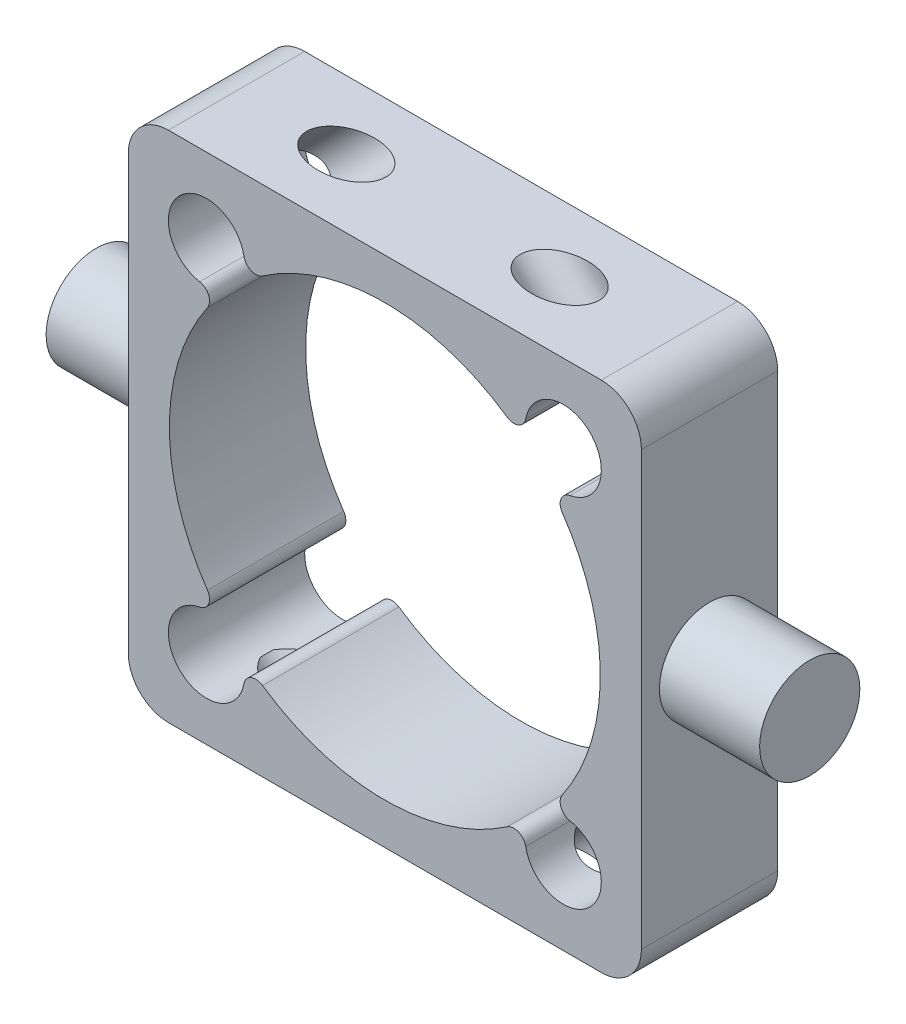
ISO-10303-21;
HEADER;
FILE_DESCRIPTION(('STEP AP214'),'2;1');
FILE_NAME('part.step','',(''),(''),'','','');
FILE_SCHEMA(('AUTOMOTIVE_DESIGN { 1 0 10303 214 1 1 1 1 }'));
ENDSEC;
DATA;
#1=APPLICATION_CONTEXT('core data for automotive mechanical design processes');
#2=APPLICATION_PROTOCOL_DEFINITION('international standard','automotive_design',2000,#1);
#3=PRODUCT_CONTEXT('',#1,'mechanical');
#4=PRODUCT('Part','Part','',(#3));
#5=PRODUCT_RELATED_PRODUCT_CATEGORY('part','',(#4));
#6=PRODUCT_DEFINITION_FORMATION('','',#4);
#7=PRODUCT_DEFINITION_CONTEXT('part definition',#1,'design');
#8=PRODUCT_DEFINITION('design','',#6,#7);
#9=PRODUCT_DEFINITION_SHAPE('','',#8);
#10=(LENGTH_UNIT() NAMED_UNIT(*) SI_UNIT(.MILLI.,.METRE.));
#11=(NAMED_UNIT(*) PLANE_ANGLE_UNIT() SI_UNIT($,.RADIAN.));
#12=(NAMED_UNIT(*) SI_UNIT($,.STERADIAN.) SOLID_ANGLE_UNIT());
#13=UNCERTAINTY_MEASURE_WITH_UNIT(LENGTH_MEASURE(1.E-05),#10,'distance_accuracy_value','');
#14=(GEOMETRIC_REPRESENTATION_CONTEXT(3) GLOBAL_UNCERTAINTY_ASSIGNED_CONTEXT((#13)) GLOBAL_UNIT_ASSIGNED_CONTEXT((#10,
#11,#12)) REPRESENTATION_CONTEXT('',''));
#15=CARTESIAN_POINT('',(0.,0.,0.));
#16=DIRECTION('',(0.,0.,1.));
#17=DIRECTION('',(1.,0.,0.));
#18=AXIS2_PLACEMENT_3D('',#15,#16,#17);
#19=CARTESIAN_POINT('',(-64.,-64.,34.));
#20=DIRECTION('',(0.,1.,0.));
#21=DIRECTION('',(-1.,0.,0.));
#22=AXIS2_PLACEMENT_3D('',#19,#20,#21);
#23=PLANE('',#22);
#24=DIRECTION('',(1.,0.,0.));
#25=VECTOR('',#24,1.);
#26=CARTESIAN_POINT('',(-64.,-64.,0.));
#27=LINE('',#26,#25);
#28=CARTESIAN_POINT('',(-54.,-64.,0.));
#29=VERTEX_POINT('',#28);
#30=CARTESIAN_POINT('',(54.,-64.,0.));
#31=VERTEX_POINT('',#30);
#32=EDGE_CURVE('E580',#29,#31,#27,.T.);
#33=ORIENTED_EDGE('',*,*,#32,.T.);
#34=DIRECTION('',(0.,0.,-1.));
#35=VECTOR('',#34,1.);
#36=CARTESIAN_POINT('',(54.,-64.,34.));
#37=LINE('',#36,#35);
#38=CARTESIAN_POINT('',(54.,-64.,34.));
#39=VERTEX_POINT('',#38);
#40=EDGE_CURVE('E429',#31,#39,#37,.F.);
#41=ORIENTED_EDGE('',*,*,#40,.T.);
#42=DIRECTION('',(1.,0.,0.));
#43=VECTOR('',#42,1.);
#44=CARTESIAN_POINT('',(-64.,-64.,34.));
#45=LINE('',#44,#43);
#46=CARTESIAN_POINT('',(-54.,-64.,34.));
#47=VERTEX_POINT('',#46);
#48=EDGE_CURVE('E568',#47,#39,#45,.T.);
#49=ORIENTED_EDGE('',*,*,#48,.F.);
#50=DIRECTION('',(0.,0.,-1.));
#51=VECTOR('',#50,1.);
#52=CARTESIAN_POINT('',(-54.,-64.,34.));
#53=LINE('',#52,#51);
#54=EDGE_CURVE('E414',#47,#29,#53,.T.);
#55=ORIENTED_EDGE('',*,*,#54,.T.);
#56=EDGE_LOOP('',(#33,#41,#49,#55));
#57=FACE_BOUND('',#56,.T.);
#58=CARTESIAN_POINT('',(26.6101730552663,-64.,17.));
#59=DIRECTION('',(0.,1.,0.));
#60=DIRECTION('',(-1.,0.,0.));
#61=AXIS2_PLACEMENT_3D('',#58,#59,#60);
#62=ELLIPSE('',#61,9.89949493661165,7.);
#63=CARTESIAN_POINT('',(16.7106781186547,-64.,17.));
#64=VERTEX_POINT('',#63);
#65=EDGE_CURVE('E311',#64,#64,#62,.T.);
#66=ORIENTED_EDGE('',*,*,#65,.T.);
#67=EDGE_LOOP('',(#66));
#68=FACE_BOUND('',#67,.T.);
#69=CARTESIAN_POINT('',(-26.6101730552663,-64.,17.));
#70=DIRECTION('',(0.,1.,0.));
#71=DIRECTION('',(1.,0.,0.));
#72=AXIS2_PLACEMENT_3D('',#69,#70,#71);
#73=ELLIPSE('',#72,9.89949493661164,7.);
#74=CARTESIAN_POINT('',(-16.7106781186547,-64.,17.));
#75=VERTEX_POINT('',#74);
#76=EDGE_CURVE('E252',#75,#75,#73,.F.);
#77=ORIENTED_EDGE('',*,*,#76,.F.);
#78=EDGE_LOOP('',(#77));
#79=FACE_BOUND('',#78,.T.);
#80=ADVANCED_FACE('F31',(#57,#68,#79),#23,.F.);
#81=CARTESIAN_POINT('',(-44.5,-44.5,34.));
#82=DIRECTION('',(0.,0.,-1.));
#83=DIRECTION('',(-1.,0.,0.));
#84=AXIS2_PLACEMENT_3D('',#81,#82,#83);
#85=CYLINDRICAL_SURFACE('',#84,9.50000000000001);
#86=DIRECTION('',(0.,0.,-1.));
#87=VECTOR('',#86,1.);
#88=CARTESIAN_POINT('',(-35.1523930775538,-46.1947698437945,34.));
#89=LINE('',#88,#87);
#90=CARTESIAN_POINT('',(-35.1523930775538,-46.1947698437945,34.));
#91=VERTEX_POINT('',#90);
#92=CARTESIAN_POINT('',(-35.1523930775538,-46.1947698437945,19.4694780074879));
#93=VERTEX_POINT('',#92);
#94=EDGE_CURVE('E251',#91,#93,#89,.T.);
#95=ORIENTED_EDGE('',*,*,#94,.T.);
#96=CARTESIAN_POINT('',(-35.1523930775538,-46.1947698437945,19.4694780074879));
#97=CARTESIAN_POINT('',(-35.1680830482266,-46.2813152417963,19.6611877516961));
#98=CARTESIAN_POINT('',(-35.1865609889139,-46.3763941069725,19.8486998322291));
#99=CARTESIAN_POINT('',(-35.2302074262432,-46.5813203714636,20.2145157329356));
#100=CARTESIAN_POINT('',(-35.2553716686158,-46.6911583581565,20.3928253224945));
#101=CARTESIAN_POINT('',(-35.3136139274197,-46.9237856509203,20.7402144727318));
#102=CARTESIAN_POINT('',(-35.3467166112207,-47.0466146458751,20.9092632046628));
#103=CARTESIAN_POINT('',(-35.4219382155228,-47.3029697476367,21.2369676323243));
#104=CARTESIAN_POINT('',(-35.4640587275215,-47.4364977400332,21.3956214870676));
#105=CARTESIAN_POINT('',(-35.5583623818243,-47.7122140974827,21.701663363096));
#106=CARTESIAN_POINT('',(-35.6105327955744,-47.854391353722,21.8490653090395));
#107=CARTESIAN_POINT('',(-35.7260215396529,-48.1458005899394,22.1320582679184));
#108=CARTESIAN_POINT('',(-35.7893391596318,-48.2950321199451,22.2676500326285));
#109=CARTESIAN_POINT('',(-35.9279758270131,-48.5985601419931,22.5259140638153));
#110=CARTESIAN_POINT('',(-36.0032754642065,-48.752848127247,22.6486067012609));
#111=CARTESIAN_POINT('',(-36.1667584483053,-49.0648750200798,22.8802471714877));
#112=CARTESIAN_POINT('',(-36.2549389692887,-49.2226131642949,22.9891980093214));
#113=CARTESIAN_POINT('',(-36.4266175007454,-49.5092746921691,23.1727871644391));
#114=CARTESIAN_POINT('',(-36.5077906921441,-49.637944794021,23.250003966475));
#115=CARTESIAN_POINT('',(-36.6790996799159,-49.8951252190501,23.394034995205));
#116=CARTESIAN_POINT('',(-36.7692336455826,-50.023635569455,23.4608513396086));
#117=CARTESIAN_POINT('',(-36.9584220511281,-50.279262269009,23.5834363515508));
#118=CARTESIAN_POINT('',(-37.0574723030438,-50.4063792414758,23.6392101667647));
#119=CARTESIAN_POINT('',(-37.2643210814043,-50.6580416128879,23.7391848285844));
#120=CARTESIAN_POINT('',(-37.3721197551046,-50.7825869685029,23.7833854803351));
#121=CARTESIAN_POINT('',(-37.5964915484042,-51.0283510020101,23.8599155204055));
#122=CARTESIAN_POINT('',(-37.7130989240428,-51.1495538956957,23.8921953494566));
#123=CARTESIAN_POINT('',(-37.9540303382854,-51.3868620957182,23.9443308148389));
#124=CARTESIAN_POINT('',(-38.078354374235,-51.5029674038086,23.9641864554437));
#125=CARTESIAN_POINT('',(-38.3338464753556,-51.7289443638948,23.9913767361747));
#126=CARTESIAN_POINT('',(-38.4650145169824,-51.8388160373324,23.9987114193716));
#127=CARTESIAN_POINT('',(-38.7331613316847,-52.0513467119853,24.000977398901));
#128=CARTESIAN_POINT('',(-38.8701398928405,-52.1540059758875,23.9959091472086));
#129=CARTESIAN_POINT('',(-39.1394436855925,-52.3447319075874,23.974441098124));
#130=CARTESIAN_POINT('',(-39.2714669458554,-52.4333153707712,23.9588222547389));
#131=CARTESIAN_POINT('',(-39.5386869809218,-52.6031130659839,23.9174683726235));
#132=CARTESIAN_POINT('',(-39.6738848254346,-52.6843247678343,23.8917298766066));
#133=CARTESIAN_POINT('',(-39.9464142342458,-52.8390287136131,23.8306545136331));
#134=CARTESIAN_POINT('',(-40.0837448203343,-52.9125243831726,23.795321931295));
#135=CARTESIAN_POINT('',(-40.3597627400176,-53.0517450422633,23.7156099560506));
#136=CARTESIAN_POINT('',(-40.4984505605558,-53.1174671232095,23.6712271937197));
#137=CARTESIAN_POINT('',(-40.7867604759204,-53.2457745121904,23.5703682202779));
#138=CARTESIAN_POINT('',(-40.9364221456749,-53.3077543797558,23.5132344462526));
#139=CARTESIAN_POINT('',(-41.235438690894,-53.4229115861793,23.3899453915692));
#140=CARTESIAN_POINT('',(-41.384793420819,-53.4760854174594,23.3237865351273));
#141=CARTESIAN_POINT('',(-41.8313969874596,-53.6228639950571,23.1127260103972));
#142=CARTESIAN_POINT('',(-42.127082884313,-53.7036811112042,22.9552767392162));
#143=CARTESIAN_POINT('',(-42.632338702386,-53.8172106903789,22.6569932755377));
#144=CARTESIAN_POINT('',(-42.8442398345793,-53.856973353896,22.5225506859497));
#145=CARTESIAN_POINT('',(-43.2609638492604,-53.9212095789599,22.2395914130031));
#146=CARTESIAN_POINT('',(-43.4657845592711,-53.9456784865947,22.0910704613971));
#147=CARTESIAN_POINT('',(-43.8666050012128,-53.9809978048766,21.7809695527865));
#148=CARTESIAN_POINT('',(-44.0626009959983,-53.9918424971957,21.6193841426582));
#149=CARTESIAN_POINT('',(-44.4439273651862,-54.0017481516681,21.2836642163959));
#150=CARTESIAN_POINT('',(-44.6292553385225,-54.0008064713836,21.1095268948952));
#151=CARTESIAN_POINT('',(-44.9772795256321,-53.9895123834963,20.7584549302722));
#152=CARTESIAN_POINT('',(-45.1406576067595,-53.979671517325,20.582180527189));
#153=CARTESIAN_POINT('',(-45.453079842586,-53.9533684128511,20.2180928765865));
#154=CARTESIAN_POINT('',(-45.6021386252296,-53.9369130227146,20.0302917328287));
#155=CARTESIAN_POINT('',(-45.8825291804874,-53.899923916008,19.6419237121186));
#156=CARTESIAN_POINT('',(-46.0138531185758,-53.879388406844,19.4413512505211));
#157=CARTESIAN_POINT('',(-46.1934455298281,-53.8480469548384,19.1300548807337));
#158=CARTESIAN_POINT('',(-46.2504957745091,-53.8374910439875,19.024354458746));
#159=CARTESIAN_POINT('',(-46.3577990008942,-53.8167365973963,18.8094114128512));
#160=CARTESIAN_POINT('',(-46.4080456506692,-53.8065384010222,18.7001656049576));
#161=CARTESIAN_POINT('',(-46.4543928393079,-53.7967923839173,18.5891639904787));
#162=B_SPLINE_CURVE_WITH_KNOTS('',3,(#96,#97,#98,#99,#100,#101,#102,#103,#104,#105,#106,#107,
#108,#109,#110,#111,#112,#113,#114,#115,#116,#117,#118,#119,#120,#121,#122,#123,#124,#125,#126,
#127,#128,#129,#130,#131,#132,#133,#134,#135,#136,#137,#138,#139,#140,#141,#142,#143,#144,#145,
#146,#147,#148,#149,#150,#151,#152,#153,#154,#155,#156,#157,#158,#159,#160,#161),.UNSPECIFIED.,
.F.,.F.,(4,2,2,2,2,2,2,2,2,2,2,2,2,2,2,2,2,2,2,2,2,2,2,2,2,2,2,2,2,2,2,2,4),(0.,
0.632388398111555,1.26437538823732,1.89835221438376,2.5324410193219,3.16573194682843,
3.79898253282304,4.431217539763,5.06331404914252,5.57463077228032,6.08584324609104,
6.59681684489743,7.10779904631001,7.62088229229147,8.13396536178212,8.64704666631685,
9.16010927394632,9.6388398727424,10.1177341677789,10.5964149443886,11.0752742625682,
11.5900662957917,12.1050628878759,13.1354052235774,13.8967883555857,14.6584030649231,
15.4203373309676,16.1824424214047,16.9033444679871,17.623502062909,18.3439767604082,
18.7054893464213,19.0673361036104),.UNSPECIFIED.);
#163=CARTESIAN_POINT('',(-46.4543928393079,-53.7967923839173,18.5891639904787));
#164=VERTEX_POINT('',#163);
#165=EDGE_CURVE('E46',#93,#164,#162,.T.);
#166=ORIENTED_EDGE('',*,*,#165,.T.);
#167=DIRECTION('',(0.,0.,-1.));
#168=VECTOR('',#167,1.);
#169=CARTESIAN_POINT('',(-46.4543928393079,-53.7967923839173,34.));
#170=LINE('',#169,#168);
#171=CARTESIAN_POINT('',(-46.4543928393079,-53.7967923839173,15.4108360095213));
#172=VERTEX_POINT('',#171);
#173=EDGE_CURVE('E11',#172,#164,#170,.F.);
#174=ORIENTED_EDGE('',*,*,#173,.F.);
#175=CARTESIAN_POINT('',(-46.4543928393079,-53.7967923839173,15.4108360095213));
#176=CARTESIAN_POINT('',(-46.4120593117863,-53.8056936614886,15.3094393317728));
#177=CARTESIAN_POINT('',(-46.3664648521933,-53.8149747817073,15.2095019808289));
#178=CARTESIAN_POINT('',(-46.2695174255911,-53.8338759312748,15.0125792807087));
#179=CARTESIAN_POINT('',(-46.2181687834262,-53.8434957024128,14.9155917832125));
#180=CARTESIAN_POINT('',(-46.0568622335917,-53.8721952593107,14.6294660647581));
#181=CARTESIAN_POINT('',(-45.9393754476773,-53.8911748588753,14.4445442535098));
#182=CARTESIAN_POINT('',(-45.6893632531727,-53.9260973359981,14.0862170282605));
#183=CARTESIAN_POINT('',(-45.5569038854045,-53.9420527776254,13.9127660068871));
#184=CARTESIAN_POINT('',(-45.2794286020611,-53.9689990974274,13.5755932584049));
#185=CARTESIAN_POINT('',(-45.1344020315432,-53.9799857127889,13.4118799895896));
#186=CARTESIAN_POINT('',(-44.8358035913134,-53.9952271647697,13.0957250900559));
#187=CARTESIAN_POINT('',(-44.6823503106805,-53.999558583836,12.9431747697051));
#188=CARTESIAN_POINT('',(-44.3669872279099,-54.0003773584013,12.6471564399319));
#189=CARTESIAN_POINT('',(-44.2050799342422,-53.9968670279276,12.5036857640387));
#190=CARTESIAN_POINT('',(-43.8737098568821,-53.9807875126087,12.2256564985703));
#191=CARTESIAN_POINT('',(-43.704233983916,-53.968202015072,12.0911144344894));
#192=CARTESIAN_POINT('',(-43.3590801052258,-53.9328362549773,11.8316267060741));
#193=CARTESIAN_POINT('',(-43.183401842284,-53.9100555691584,11.7066814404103));
#194=CARTESIAN_POINT('',(-42.8322511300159,-53.8541044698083,11.4706604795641));
#195=CARTESIAN_POINT('',(-42.6569303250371,-53.8212659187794,11.359281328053));
#196=CARTESIAN_POINT('',(-42.302486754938,-53.7441236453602,11.1470427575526));
#197=CARTESIAN_POINT('',(-42.1233645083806,-53.6998214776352,11.0461819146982));
#198=CARTESIAN_POINT('',(-41.7626845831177,-53.5990174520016,10.8561343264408));
#199=CARTESIAN_POINT('',(-41.5811305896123,-53.542532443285,10.7669317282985));
#200=CARTESIAN_POINT('',(-41.2166818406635,-53.4166676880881,10.6012567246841));
#201=CARTESIAN_POINT('',(-41.0337873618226,-53.3472905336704,10.5247817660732));
#202=CARTESIAN_POINT('',(-40.7007878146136,-53.2087580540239,10.3982613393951));
#203=CARTESIAN_POINT('',(-40.5506469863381,-53.1417658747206,10.3459346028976));
#204=CARTESIAN_POINT('',(-40.2514940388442,-52.9986865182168,10.25153045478));
#205=CARTESIAN_POINT('',(-40.1024816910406,-52.9226012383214,10.2094509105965));
#206=CARTESIAN_POINT('',(-39.8066863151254,-52.7614262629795,10.1362789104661));
#207=CARTESIAN_POINT('',(-39.6599026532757,-52.67633918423,10.1051832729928));
#208=CARTESIAN_POINT('',(-39.3696756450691,-52.4974263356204,10.054626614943));
#209=CARTESIAN_POINT('',(-39.2262323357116,-52.4036004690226,10.0351657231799));
#210=CARTESIAN_POINT('',(-38.9432083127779,-52.2072606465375,10.0083565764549));
#211=CARTESIAN_POINT('',(-38.8036492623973,-52.1047074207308,10.0010664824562));
#212=CARTESIAN_POINT('',(-38.5302959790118,-51.8920644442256,9.99915105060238));
#213=CARTESIAN_POINT('',(-38.3965017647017,-51.7819746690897,10.004525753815));
#214=CARTESIAN_POINT('',(-38.135783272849,-51.5552525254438,10.0280971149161));
#215=CARTESIAN_POINT('',(-38.0088583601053,-51.4386207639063,10.0462925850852));
#216=CARTESIAN_POINT('',(-37.762799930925,-51.1999633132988,10.0954370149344));
#217=CARTESIAN_POINT('',(-37.6436660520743,-51.0779378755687,10.1263853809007));
#218=CARTESIAN_POINT('',(-37.4228026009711,-50.8393711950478,10.19787251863));
#219=CARTESIAN_POINT('',(-37.3204396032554,-50.7231360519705,10.2374840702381));
#220=CARTESIAN_POINT('',(-37.1233050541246,-50.4881468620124,10.3269804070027));
#221=CARTESIAN_POINT('',(-37.0285360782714,-50.3693919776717,10.3768686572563));
#222=CARTESIAN_POINT('',(-36.8468782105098,-50.1304735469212,10.4864447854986));
#223=CARTESIAN_POINT('',(-36.7599862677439,-50.0103105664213,10.5461288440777));
#224=CARTESIAN_POINT('',(-36.5940726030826,-49.769509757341,10.6748052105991));
#225=CARTESIAN_POINT('',(-36.5150539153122,-49.6488717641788,10.7438010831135));
#226=CARTESIAN_POINT('',(-36.2801942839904,-49.2723858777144,10.9733069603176));
#227=CARTESIAN_POINT('',(-36.1380383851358,-49.0172470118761,11.1493830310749));
#228=CARTESIAN_POINT('',(-35.8866905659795,-48.5173984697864,11.5364280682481));
#229=CARTESIAN_POINT('',(-35.7775372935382,-48.2727013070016,11.7474374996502));
#230=CARTESIAN_POINT('',(-35.5731246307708,-47.7631010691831,12.2368433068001));
#231=CARTESIAN_POINT('',(-35.4829562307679,-47.5013171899,12.5206190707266));
#232=CARTESIAN_POINT('',(-35.3351098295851,-47.0138689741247,13.1247340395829));
#233=CARTESIAN_POINT('',(-35.2773788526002,-46.7881461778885,13.4450125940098));
#234=CARTESIAN_POINT('',(-35.2158341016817,-46.5148905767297,13.9022218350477));
#235=CARTESIAN_POINT('',(-35.2011715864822,-46.4458368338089,14.0251769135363));
#236=CARTESIAN_POINT('',(-35.1747219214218,-46.314835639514,14.2749592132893));
#237=CARTESIAN_POINT('',(-35.1629320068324,-46.2528813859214,14.4017825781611));
#238=CARTESIAN_POINT('',(-35.1523930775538,-46.1947698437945,14.5305219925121));
#239=B_SPLINE_CURVE_WITH_KNOTS('',3,(#175,#176,#177,#178,#179,#180,#181,#182,#183,#184,#185,
#186,#187,#188,#189,#190,#191,#192,#193,#194,#195,#196,#197,#198,#199,#200,#201,#202,#203,#204,
#205,#206,#207,#208,#209,#210,#211,#212,#213,#214,#215,#216,#217,#218,#219,#220,#221,#222,#223,
#224,#225,#226,#227,#228,#229,#230,#231,#232,#233,#234,#235,#236,#237,#238),.UNSPECIFIED.,.F.,
.F.,(4,2,2,2,2,2,2,2,2,2,2,2,2,2,2,2,2,2,2,2,2,2,2,2,2,2,2,2,2,2,2,4),(0.,0.330565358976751,
0.660883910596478,1.31949673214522,1.97531026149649,2.63168535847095,3.28044932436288,
3.92902187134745,4.57876314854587,5.22853140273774,5.85882495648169,6.48903307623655,
7.11837512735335,7.74759078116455,8.26469079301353,8.78168309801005,9.29852553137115,
9.81537368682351,10.3346847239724,10.85399744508,11.3732620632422,11.892502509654,
12.3715711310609,12.8508015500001,13.3298455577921,13.809073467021,14.8279167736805,
15.8479486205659,17.0327190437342,18.2155488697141,18.640678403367,19.0653971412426),.UNSPECIFIED.);
#240=CARTESIAN_POINT('',(-35.1523930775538,-46.1947698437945,14.5305219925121));
#241=VERTEX_POINT('',#240);
#242=EDGE_CURVE('E246',#172,#241,#239,.T.);
#243=ORIENTED_EDGE('',*,*,#242,.T.);
#244=CARTESIAN_POINT('',(-35.1523930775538,-46.1947698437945,0.));
#245=VERTEX_POINT('',#244);
#246=EDGE_CURVE('E551',#241,#245,#89,.T.);
#247=ORIENTED_EDGE('',*,*,#246,.T.);
#248=CARTESIAN_POINT('',(-44.5,-44.5,0.));
#249=DIRECTION('',(0.,0.,1.));
#250=DIRECTION('',(1.,0.,0.));
#251=AXIS2_PLACEMENT_3D('',#248,#249,#250);
#252=CIRCLE('',#251,9.50000000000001);
#253=CARTESIAN_POINT('',(-46.1947698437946,-35.1523930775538,0.));
#254=VERTEX_POINT('',#253);
#255=EDGE_CURVE('E706',#254,#245,#252,.T.);
#256=ORIENTED_EDGE('',*,*,#255,.F.);
#257=DIRECTION('',(0.,0.,-1.));
#258=VECTOR('',#257,1.);
#259=CARTESIAN_POINT('',(-46.1947698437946,-35.1523930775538,34.));
#260=LINE('',#259,#258);
#261=CARTESIAN_POINT('',(-46.1947698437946,-35.1523930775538,34.));
#262=VERTEX_POINT('',#261);
#263=EDGE_CURVE('E553',#262,#254,#260,.T.);
#264=ORIENTED_EDGE('',*,*,#263,.F.);
#265=CARTESIAN_POINT('',(-44.5,-44.5,34.));
#266=DIRECTION('',(0.,0.,1.));
#267=DIRECTION('',(1.,0.,0.));
#268=AXIS2_PLACEMENT_3D('',#265,#266,#267);
#269=CIRCLE('',#268,9.50000000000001);
#270=EDGE_CURVE('E671',#262,#91,#269,.T.);
#271=ORIENTED_EDGE('',*,*,#270,.T.);
#272=EDGE_LOOP('',(#95,#166,#174,#243,#247,#256,#264,#271));
#273=FACE_BOUND('',#272,.T.);
#274=ADVANCED_FACE('F249',(#273),#85,.F.);
#275=CARTESIAN_POINT('',(-32.2005172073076,-46.7299603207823,34.));
#276=DIRECTION('',(0.,0.,-1.));
#277=DIRECTION('',(-1.,0.,0.));
#278=AXIS2_PLACEMENT_3D('',#275,#276,#277);
#279=CYLINDRICAL_SURFACE('',#278,3.);
#280=ORIENTED_EDGE('',*,*,#246,.F.);
#281=CARTESIAN_POINT('',(-35.1523930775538,-46.1947698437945,14.5305219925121));
#282=CARTESIAN_POINT('',(-35.1465141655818,-46.1623758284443,14.6022962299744));
#283=CARTESIAN_POINT('',(-35.1404117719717,-46.131720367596,14.6748170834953));
#284=CARTESIAN_POINT('',(-35.1280276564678,-46.0737847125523,14.8211609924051));
#285=CARTESIAN_POINT('',(-35.1217459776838,-46.0465037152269,14.8949837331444));
#286=CARTESIAN_POINT('',(-35.1030431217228,-45.9696066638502,15.1179997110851));
#287=CARTESIAN_POINT('',(-35.0907494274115,-45.9248627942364,15.2689060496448));
#288=CARTESIAN_POINT('',(-35.0681093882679,-45.8476165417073,15.5740247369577));
#289=CARTESIAN_POINT('',(-35.057764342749,-45.8151223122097,15.7282392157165));
#290=CARTESIAN_POINT('',(-35.0401320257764,-45.761778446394,16.038879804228));
#291=CARTESIAN_POINT('',(-35.0328455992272,-45.7409320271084,16.1953065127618));
#292=CARTESIAN_POINT('',(-35.0219321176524,-45.7102111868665,16.5121271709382));
#293=CARTESIAN_POINT('',(-35.0183714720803,-45.7005355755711,16.6725425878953));
#294=CARTESIAN_POINT('',(-35.0154642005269,-45.6926122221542,16.9936944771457));
#295=CARTESIAN_POINT('',(-35.0161176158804,-45.6943645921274,17.1544309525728));
#296=CARTESIAN_POINT('',(-35.0215755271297,-45.7093268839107,17.4751253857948));
#297=CARTESIAN_POINT('',(-35.0263755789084,-45.7225245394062,17.6350839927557));
#298=CARTESIAN_POINT('',(-35.0396779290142,-45.7606415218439,17.9534342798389));
#299=CARTESIAN_POINT('',(-35.0481795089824,-45.7855585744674,18.1118262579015));
#300=CARTESIAN_POINT('',(-35.0646125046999,-45.8369836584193,18.3721510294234));
#301=CARTESIAN_POINT('',(-35.0717409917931,-45.8600205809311,18.4748315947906));
#302=CARTESIAN_POINT('',(-35.0868569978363,-45.9115690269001,18.6787207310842));
#303=CARTESIAN_POINT('',(-35.0948442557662,-45.9400788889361,18.7799297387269));
#304=CARTESIAN_POINT('',(-35.1112354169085,-46.0027888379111,18.980505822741));
#305=CARTESIAN_POINT('',(-35.1196391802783,-46.0369870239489,19.0798735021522));
#306=CARTESIAN_POINT('',(-35.1362853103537,-46.111345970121,19.2764327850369));
#307=CARTESIAN_POINT('',(-35.1445275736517,-46.1515104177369,19.3736229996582));
#308=CARTESIAN_POINT('',(-35.1523930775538,-46.1947698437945,19.4694780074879));
#309=B_SPLINE_CURVE_WITH_KNOTS('',3,(#281,#282,#283,#284,#285,#286,#287,#288,#289,#290,#291,
#292,#293,#294,#295,#296,#297,#298,#299,#300,#301,#302,#303,#304,#305,#306,#307,#308),
.UNSPECIFIED.,.F.,.F.,(4,2,2,2,2,2,2,2,2,2,2,2,2,4),(0.,0.236841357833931,0.473626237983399,
0.946653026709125,1.41999411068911,1.89346586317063,2.37524018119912,2.85701922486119,
3.33828256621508,3.81945254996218,4.13573744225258,4.45192647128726,4.76801004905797,
5.08428980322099),.UNSPECIFIED.);
#310=EDGE_CURVE('E39',#241,#93,#309,.T.);
#311=ORIENTED_EDGE('',*,*,#310,.T.);
#312=ORIENTED_EDGE('',*,*,#94,.F.);
#313=CARTESIAN_POINT('',(-32.2005172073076,-46.7299603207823,34.));
#314=DIRECTION('',(0.,0.,-1.));
#315=DIRECTION('',(1.,0.,0.));
#316=AXIS2_PLACEMENT_3D('',#313,#314,#315);
#317=CIRCLE('',#316,3.);
#318=CARTESIAN_POINT('',(-30.4982872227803,-44.259654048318,34.));
#319=VERTEX_POINT('',#318);
#320=EDGE_CURVE('E673',#91,#319,#317,.T.);
#321=ORIENTED_EDGE('',*,*,#320,.T.);
#322=DIRECTION('',(0.,0.,-1.));
#323=VECTOR('',#322,1.);
#324=CARTESIAN_POINT('',(-30.4982872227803,-44.259654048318,34.));
#325=LINE('',#324,#323);
#326=CARTESIAN_POINT('',(-30.4982872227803,-44.259654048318,0.));
#327=VERTEX_POINT('',#326);
#328=EDGE_CURVE('E549',#319,#327,#325,.T.);
#329=ORIENTED_EDGE('',*,*,#328,.T.);
#330=CARTESIAN_POINT('',(-32.2005172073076,-46.7299603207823,0.));
#331=DIRECTION('',(0.,0.,-1.));
#332=DIRECTION('',(1.,0.,0.));
#333=AXIS2_PLACEMENT_3D('',#330,#331,#332);
#334=CIRCLE('',#333,3.);
#335=EDGE_CURVE('E709',#245,#327,#334,.T.);
#336=ORIENTED_EDGE('',*,*,#335,.F.);
#337=EDGE_LOOP('',(#280,#311,#312,#321,#329,#336));
#338=FACE_BOUND('',#337,.T.);
#339=ADVANCED_FACE('F287',(#338),#279,.T.);
#340=CARTESIAN_POINT('',(-64.,64.,34.));
#341=DIRECTION('',(0.,-1.,0.));
#342=DIRECTION('',(1.,0.,0.));
#343=AXIS2_PLACEMENT_3D('',#340,#341,#342);
#344=PLANE('',#343);
#345=CARTESIAN_POINT('',(-26.6101730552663,64.,17.));
#346=DIRECTION('',(0.,-1.,0.));
#347=DIRECTION('',(1.,0.,0.));
#348=AXIS2_PLACEMENT_3D('',#345,#346,#347);
#349=ELLIPSE('',#348,9.89949493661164,7.);
#350=CARTESIAN_POINT('',(-16.7106781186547,64.,17.));
#351=VERTEX_POINT('',#350);
#352=EDGE_CURVE('E360',#351,#351,#349,.T.);
#353=ORIENTED_EDGE('',*,*,#352,.T.);
#354=EDGE_LOOP('',(#353));
#355=FACE_BOUND('',#354,.T.);
#356=DIRECTION('',(-1.,0.,0.));
#357=VECTOR('',#356,1.);
#358=CARTESIAN_POINT('',(-64.,64.,34.));
#359=LINE('',#358,#357);
#360=CARTESIAN_POINT('',(54.,64.,34.));
#361=VERTEX_POINT('',#360);
#362=CARTESIAN_POINT('',(-54.,64.,34.));
#363=VERTEX_POINT('',#362);
#364=EDGE_CURVE('E574',#361,#363,#359,.T.);
#365=ORIENTED_EDGE('',*,*,#364,.F.);
#366=DIRECTION('',(0.,0.,-1.));
#367=VECTOR('',#366,1.);
#368=CARTESIAN_POINT('',(54.,64.,34.));
#369=LINE('',#368,#367);
#370=CARTESIAN_POINT('',(54.,64.,0.));
#371=VERTEX_POINT('',#370);
#372=EDGE_CURVE('E592',#361,#371,#369,.T.);
#373=ORIENTED_EDGE('',*,*,#372,.T.);
#374=DIRECTION('',(-1.,0.,0.));
#375=VECTOR('',#374,1.);
#376=CARTESIAN_POINT('',(-64.,64.,0.));
#377=LINE('',#376,#375);
#378=CARTESIAN_POINT('',(-54.,64.,0.));
#379=VERTEX_POINT('',#378);
#380=EDGE_CURVE('E569',#371,#379,#377,.T.);
#381=ORIENTED_EDGE('',*,*,#380,.T.);
#382=DIRECTION('',(0.,0.,-1.));
#383=VECTOR('',#382,1.);
#384=CARTESIAN_POINT('',(-54.,64.,34.));
#385=LINE('',#384,#383);
#386=EDGE_CURVE('E590',#379,#363,#385,.F.);
#387=ORIENTED_EDGE('',*,*,#386,.T.);
#388=EDGE_LOOP('',(#365,#373,#381,#387));
#389=FACE_BOUND('',#388,.T.);
#390=CARTESIAN_POINT('',(26.6101730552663,64.,17.));
#391=DIRECTION('',(0.,-1.,0.));
#392=DIRECTION('',(-1.,0.,0.));
#393=AXIS2_PLACEMENT_3D('',#390,#391,#392);
#394=ELLIPSE('',#393,9.89949493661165,7.);
#395=CARTESIAN_POINT('',(16.7106781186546,64.,17.));
#396=VERTEX_POINT('',#395);
#397=EDGE_CURVE('E653',#396,#396,#394,.F.);
#398=ORIENTED_EDGE('',*,*,#397,.F.);
#399=EDGE_LOOP('',(#398));
#400=FACE_BOUND('',#399,.T.);
#401=ADVANCED_FACE('F291',(#355,#389,#400),#344,.F.);
#402=CARTESIAN_POINT('',(44.5,44.5,34.));
#403=DIRECTION('',(0.,0.,-1.));
#404=DIRECTION('',(-1.,0.,0.));
#405=AXIS2_PLACEMENT_3D('',#402,#403,#404);
#406=CYLINDRICAL_SURFACE('',#405,9.5);
#407=DIRECTION('',(0.,0.,-1.));
#408=VECTOR('',#407,1.);
#409=CARTESIAN_POINT('',(35.1523930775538,46.1947698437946,34.));
#410=LINE('',#409,#408);
#411=CARTESIAN_POINT('',(35.1523930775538,46.1947698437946,34.));
#412=VERTEX_POINT('',#411);
#413=CARTESIAN_POINT('',(35.1523930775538,46.1947698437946,19.469478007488));
#414=VERTEX_POINT('',#413);
#415=EDGE_CURVE('E534',#412,#414,#410,.T.);
#416=ORIENTED_EDGE('',*,*,#415,.T.);
#417=CARTESIAN_POINT('',(35.1523930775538,46.1947698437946,19.469478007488));
#418=CARTESIAN_POINT('',(35.1680830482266,46.2813152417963,19.6611877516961));
#419=CARTESIAN_POINT('',(35.1865609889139,46.3763941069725,19.8486998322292));
#420=CARTESIAN_POINT('',(35.2302074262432,46.5813203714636,20.2145157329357));
#421=CARTESIAN_POINT('',(35.2553716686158,46.6911583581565,20.3928253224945));
#422=CARTESIAN_POINT('',(35.3136139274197,46.9237856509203,20.7402144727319));
#423=CARTESIAN_POINT('',(35.3467166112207,47.0466146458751,20.9092632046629));
#424=CARTESIAN_POINT('',(35.4219382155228,47.3029697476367,21.2369676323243));
#425=CARTESIAN_POINT('',(35.4640587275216,47.4364977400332,21.3956214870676));
#426=CARTESIAN_POINT('',(35.5583623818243,47.7122140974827,21.701663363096));
#427=CARTESIAN_POINT('',(35.6105327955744,47.854391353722,21.8490653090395));
#428=CARTESIAN_POINT('',(35.7260215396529,48.1458005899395,22.1320582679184));
#429=CARTESIAN_POINT('',(35.7893391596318,48.2950321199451,22.2676500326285));
#430=CARTESIAN_POINT('',(35.9279758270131,48.5985601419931,22.5259140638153));
#431=CARTESIAN_POINT('',(36.0032754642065,48.7528481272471,22.6486067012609));
#432=CARTESIAN_POINT('',(36.1667584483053,49.0648750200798,22.8802471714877));
#433=CARTESIAN_POINT('',(36.2549389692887,49.2226131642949,22.9891980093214));
#434=CARTESIAN_POINT('',(36.4266175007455,49.5092746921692,23.1727871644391));
#435=CARTESIAN_POINT('',(36.5077906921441,49.637944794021,23.250003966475));
#436=CARTESIAN_POINT('',(36.6790996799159,49.8951252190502,23.394034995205));
#437=CARTESIAN_POINT('',(36.7692336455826,50.023635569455,23.4608513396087));
#438=CARTESIAN_POINT('',(36.9584220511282,50.279262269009,23.5834363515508));
#439=CARTESIAN_POINT('',(37.0574723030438,50.4063792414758,23.6392101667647));
#440=CARTESIAN_POINT('',(37.2643210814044,50.6580416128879,23.7391848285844));
#441=CARTESIAN_POINT('',(37.3721197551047,50.7825869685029,23.7833854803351));
#442=CARTESIAN_POINT('',(37.5964915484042,51.0283510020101,23.8599155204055));
#443=CARTESIAN_POINT('',(37.7130989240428,51.1495538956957,23.8921953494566));
#444=CARTESIAN_POINT('',(37.9540303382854,51.3868620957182,23.9443308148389));
#445=CARTESIAN_POINT('',(38.078354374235,51.5029674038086,23.9641864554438));
#446=CARTESIAN_POINT('',(38.3338464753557,51.7289443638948,23.9913767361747));
#447=CARTESIAN_POINT('',(38.4650145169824,51.8388160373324,23.9987114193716));
#448=CARTESIAN_POINT('',(38.7331613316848,52.0513467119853,24.000977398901));
#449=CARTESIAN_POINT('',(38.8701398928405,52.1540059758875,23.9959091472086));
#450=CARTESIAN_POINT('',(39.1394436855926,52.3447319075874,23.974441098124));
#451=CARTESIAN_POINT('',(39.2714669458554,52.4333153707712,23.9588222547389));
#452=CARTESIAN_POINT('',(39.5386869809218,52.6031130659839,23.9174683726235));
#453=CARTESIAN_POINT('',(39.6738848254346,52.6843247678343,23.8917298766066));
#454=CARTESIAN_POINT('',(39.9464142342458,52.8390287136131,23.8306545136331));
#455=CARTESIAN_POINT('',(40.0837448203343,52.9125243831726,23.795321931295));
#456=CARTESIAN_POINT('',(40.3597627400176,53.0517450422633,23.7156099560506));
#457=CARTESIAN_POINT('',(40.4984505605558,53.1174671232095,23.6712271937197));
#458=CARTESIAN_POINT('',(40.7867604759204,53.2457745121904,23.5703682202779));
#459=CARTESIAN_POINT('',(40.9364221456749,53.3077543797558,23.5132344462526));
#460=CARTESIAN_POINT('',(41.235438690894,53.4229115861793,23.3899453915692));
#461=CARTESIAN_POINT('',(41.384793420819,53.4760854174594,23.3237865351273));
#462=CARTESIAN_POINT('',(41.8313969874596,53.6228639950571,23.1127260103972));
#463=CARTESIAN_POINT('',(42.127082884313,53.7036811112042,22.9552767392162));
#464=CARTESIAN_POINT('',(42.6323387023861,53.8172106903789,22.6569932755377));
#465=CARTESIAN_POINT('',(42.8442398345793,53.856973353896,22.5225506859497));
#466=CARTESIAN_POINT('',(43.2609638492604,53.9212095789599,22.2395914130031));
#467=CARTESIAN_POINT('',(43.4657845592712,53.9456784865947,22.091070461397));
#468=CARTESIAN_POINT('',(43.8666050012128,53.9809978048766,21.7809695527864));
#469=CARTESIAN_POINT('',(44.0626009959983,53.9918424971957,21.6193841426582));
#470=CARTESIAN_POINT('',(44.4439273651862,54.0017481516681,21.2836642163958));
#471=CARTESIAN_POINT('',(44.6292553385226,54.0008064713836,21.1095268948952));
#472=CARTESIAN_POINT('',(44.9772795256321,53.9895123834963,20.7584549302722));
#473=CARTESIAN_POINT('',(45.1406576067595,53.979671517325,20.582180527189));
#474=CARTESIAN_POINT('',(45.453079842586,53.9533684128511,20.2180928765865));
#475=CARTESIAN_POINT('',(45.6021386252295,53.9369130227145,20.0302917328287));
#476=CARTESIAN_POINT('',(45.8825291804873,53.899923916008,19.6419237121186));
#477=CARTESIAN_POINT('',(46.0138531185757,53.879388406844,19.4413512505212));
#478=CARTESIAN_POINT('',(46.1934455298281,53.8480469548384,19.1300548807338));
#479=CARTESIAN_POINT('',(46.2504957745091,53.8374910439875,19.0243544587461));
#480=CARTESIAN_POINT('',(46.3577990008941,53.8167365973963,18.8094114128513));
#481=CARTESIAN_POINT('',(46.4080456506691,53.8065384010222,18.7001656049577));
#482=CARTESIAN_POINT('',(46.4543928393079,53.7967923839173,18.5891639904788));
#483=B_SPLINE_CURVE_WITH_KNOTS('',3,(#417,#418,#419,#420,#421,#422,#423,#424,#425,#426,#427,
#428,#429,#430,#431,#432,#433,#434,#435,#436,#437,#438,#439,#440,#441,#442,#443,#444,#445,#446,
#447,#448,#449,#450,#451,#452,#453,#454,#455,#456,#457,#458,#459,#460,#461,#462,#463,#464,#465,
#466,#467,#468,#469,#470,#471,#472,#473,#474,#475,#476,#477,#478,#479,#480,#481,#482),
.UNSPECIFIED.,.F.,.F.,(4,2,2,2,2,2,2,2,2,2,2,2,2,2,2,2,2,2,2,2,2,2,2,2,2,2,2,2,2,2,2,2,4),(0.,
0.632388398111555,1.26437538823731,1.89835221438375,2.5324410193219,3.16573194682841,
3.79898253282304,4.431217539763,5.06331404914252,5.57463077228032,6.08584324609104,
6.59681684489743,7.10779904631,7.62088229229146,8.13396536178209,8.64704666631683,
9.1601092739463,9.63883987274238,10.1177341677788,10.5964149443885,11.0752742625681,
11.5900662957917,12.1050628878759,13.1354052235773,13.8967883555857,14.6584030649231,
15.4203373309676,16.1824424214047,16.9033444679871,17.6235020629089,18.3439767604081,
18.7054893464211,19.0673361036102),.UNSPECIFIED.);
#484=CARTESIAN_POINT('',(46.4543928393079,53.7967923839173,18.5891639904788));
#485=VERTEX_POINT('',#484);
#486=EDGE_CURVE('E460',#414,#485,#483,.T.);
#487=ORIENTED_EDGE('',*,*,#486,.T.);
#488=DIRECTION('',(0.,0.,-1.));
#489=VECTOR('',#488,1.);
#490=CARTESIAN_POINT('',(46.4543928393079,53.7967923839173,34.));
#491=LINE('',#490,#489);
#492=CARTESIAN_POINT('',(46.4543928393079,53.7967923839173,15.4108360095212));
#493=VERTEX_POINT('',#492);
#494=EDGE_CURVE('E442',#493,#485,#491,.F.);
#495=ORIENTED_EDGE('',*,*,#494,.F.);
#496=CARTESIAN_POINT('',(46.4543928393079,53.7967923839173,15.4108360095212));
#497=CARTESIAN_POINT('',(46.4120593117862,53.8056936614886,15.3094393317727));
#498=CARTESIAN_POINT('',(46.3664648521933,53.8149747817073,15.2095019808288));
#499=CARTESIAN_POINT('',(46.269517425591,53.8338759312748,15.0125792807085));
#500=CARTESIAN_POINT('',(46.2181687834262,53.8434957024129,14.9155917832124));
#501=CARTESIAN_POINT('',(46.0568622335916,53.8721952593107,14.6294660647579));
#502=CARTESIAN_POINT('',(45.9393754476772,53.8911748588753,14.4445442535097));
#503=CARTESIAN_POINT('',(45.6893632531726,53.9260973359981,14.0862170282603));
#504=CARTESIAN_POINT('',(45.5569038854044,53.9420527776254,13.9127660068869));
#505=CARTESIAN_POINT('',(45.279428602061,53.9689990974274,13.5755932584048));
#506=CARTESIAN_POINT('',(45.1344020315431,53.9799857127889,13.4118799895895));
#507=CARTESIAN_POINT('',(44.8358035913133,53.9952271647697,13.0957250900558));
#508=CARTESIAN_POINT('',(44.6823503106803,53.999558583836,12.943174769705));
#509=CARTESIAN_POINT('',(44.3669872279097,54.0003773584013,12.6471564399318));
#510=CARTESIAN_POINT('',(44.205079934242,53.9968670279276,12.5036857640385));
#511=CARTESIAN_POINT('',(43.8737098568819,53.9807875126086,12.2256564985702));
#512=CARTESIAN_POINT('',(43.7042339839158,53.968202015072,12.0911144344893));
#513=CARTESIAN_POINT('',(43.3590801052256,53.9328362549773,11.831626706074));
#514=CARTESIAN_POINT('',(43.1834018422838,53.9100555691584,11.7066814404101));
#515=CARTESIAN_POINT('',(42.8322511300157,53.8541044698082,11.4706604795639));
#516=CARTESIAN_POINT('',(42.6569303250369,53.8212659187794,11.3592813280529));
#517=CARTESIAN_POINT('',(42.3024867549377,53.7441236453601,11.1470427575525));
#518=CARTESIAN_POINT('',(42.1233645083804,53.6998214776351,11.0461819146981));
#519=CARTESIAN_POINT('',(41.7626845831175,53.5990174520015,10.8561343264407));
#520=CARTESIAN_POINT('',(41.5811305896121,53.5425324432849,10.7669317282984));
#521=CARTESIAN_POINT('',(41.2166818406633,53.416667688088,10.601256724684));
#522=CARTESIAN_POINT('',(41.0337873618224,53.3472905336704,10.5247817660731));
#523=CARTESIAN_POINT('',(40.7007878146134,53.2087580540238,10.3982613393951));
#524=CARTESIAN_POINT('',(40.5506469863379,53.1417658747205,10.3459346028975));
#525=CARTESIAN_POINT('',(40.251494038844,52.9986865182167,10.25153045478));
#526=CARTESIAN_POINT('',(40.1024816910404,52.9226012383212,10.2094509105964));
#527=CARTESIAN_POINT('',(39.8066863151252,52.7614262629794,10.136278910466));
#528=CARTESIAN_POINT('',(39.6599026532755,52.6763391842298,10.1051832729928));
#529=CARTESIAN_POINT('',(39.3696756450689,52.4974263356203,10.0546266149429));
#530=CARTESIAN_POINT('',(39.2262323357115,52.4036004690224,10.0351657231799));
#531=CARTESIAN_POINT('',(38.9432083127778,52.2072606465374,10.0083565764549));
#532=CARTESIAN_POINT('',(38.8036492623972,52.1047074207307,10.0010664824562));
#533=CARTESIAN_POINT('',(38.5302959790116,51.8920644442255,9.99915105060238));
#534=CARTESIAN_POINT('',(38.3965017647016,51.7819746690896,10.004525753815));
#535=CARTESIAN_POINT('',(38.1357832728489,51.5552525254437,10.0280971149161));
#536=CARTESIAN_POINT('',(38.0088583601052,51.4386207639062,10.0462925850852));
#537=CARTESIAN_POINT('',(37.7627999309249,51.1999633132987,10.0954370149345));
#538=CARTESIAN_POINT('',(37.6436660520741,51.0779378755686,10.1263853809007));
#539=CARTESIAN_POINT('',(37.422802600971,50.8393711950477,10.1978725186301));
#540=CARTESIAN_POINT('',(37.3204396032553,50.7231360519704,10.2374840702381));
#541=CARTESIAN_POINT('',(37.1233050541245,50.4881468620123,10.3269804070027));
#542=CARTESIAN_POINT('',(37.0285360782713,50.3693919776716,10.3768686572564));
#543=CARTESIAN_POINT('',(36.8468782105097,50.130473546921,10.4864447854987));
#544=CARTESIAN_POINT('',(36.7599862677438,50.0103105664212,10.5461288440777));
#545=CARTESIAN_POINT('',(36.5940726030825,49.7695097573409,10.6748052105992));
#546=CARTESIAN_POINT('',(36.5150539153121,49.6488717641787,10.7438010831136));
#547=CARTESIAN_POINT('',(36.2801942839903,49.2723858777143,10.9733069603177));
#548=CARTESIAN_POINT('',(36.1380383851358,49.017247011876,11.149383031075));
#549=CARTESIAN_POINT('',(35.8866905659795,48.5173984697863,11.5364280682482));
#550=CARTESIAN_POINT('',(35.7775372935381,48.2727013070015,11.7474374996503));
#551=CARTESIAN_POINT('',(35.5731246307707,47.763101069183,12.2368433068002));
#552=CARTESIAN_POINT('',(35.4829562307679,47.5013171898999,12.5206190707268));
#553=CARTESIAN_POINT('',(35.3351098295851,47.0138689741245,13.1247340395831));
#554=CARTESIAN_POINT('',(35.2773788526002,46.7881461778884,13.44501259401));
#555=CARTESIAN_POINT('',(35.2158341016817,46.5148905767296,13.9022218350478));
#556=CARTESIAN_POINT('',(35.2011715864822,46.4458368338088,14.0251769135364));
#557=CARTESIAN_POINT('',(35.1747219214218,46.314835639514,14.2749592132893));
#558=CARTESIAN_POINT('',(35.1629320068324,46.2528813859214,14.4017825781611));
#559=CARTESIAN_POINT('',(35.1523930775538,46.1947698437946,14.530521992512));
#560=B_SPLINE_CURVE_WITH_KNOTS('',3,(#496,#497,#498,#499,#500,#501,#502,#503,#504,#505,#506,
#507,#508,#509,#510,#511,#512,#513,#514,#515,#516,#517,#518,#519,#520,#521,#522,#523,#524,#525,
#526,#527,#528,#529,#530,#531,#532,#533,#534,#535,#536,#537,#538,#539,#540,#541,#542,#543,#544,
#545,#546,#547,#548,#549,#550,#551,#552,#553,#554,#555,#556,#557,#558,#559),.UNSPECIFIED.,.F.,
.F.,(4,2,2,2,2,2,2,2,2,2,2,2,2,2,2,2,2,2,2,2,2,2,2,2,2,2,2,2,2,2,2,4),(0.,0.330565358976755,
0.660883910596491,1.31949673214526,1.97531026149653,2.63168535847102,3.28044932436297,
3.92902187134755,4.57876314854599,5.22853140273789,5.85882495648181,6.48903307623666,
7.11837512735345,7.74759078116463,8.26469079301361,8.78168309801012,9.29852553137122,
9.81537368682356,10.3346847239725,10.8539974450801,11.3732620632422,11.892502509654,
12.371571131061,12.8508015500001,13.3298455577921,13.809073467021,14.8279167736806,
15.847948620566,17.0327190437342,18.2155488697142,18.640678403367,19.0653971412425),.UNSPECIFIED.);
#561=CARTESIAN_POINT('',(35.1523930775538,46.1947698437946,14.530521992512));
#562=VERTEX_POINT('',#561);
#563=EDGE_CURVE('E455',#493,#562,#560,.T.);
#564=ORIENTED_EDGE('',*,*,#563,.T.);
#565=CARTESIAN_POINT('',(35.1523930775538,46.1947698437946,0.));
#566=VERTEX_POINT('',#565);
#567=EDGE_CURVE('E533',#562,#566,#410,.T.);
#568=ORIENTED_EDGE('',*,*,#567,.T.);
#569=CARTESIAN_POINT('',(44.5,44.5,0.));
#570=DIRECTION('',(0.,0.,1.));
#571=DIRECTION('',(1.,0.,0.));
#572=AXIS2_PLACEMENT_3D('',#569,#570,#571);
#573=CIRCLE('',#572,9.5);
#574=CARTESIAN_POINT('',(46.1947698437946,35.1523930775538,0.));
#575=VERTEX_POINT('',#574);
#576=EDGE_CURVE('E517',#575,#566,#573,.T.);
#577=ORIENTED_EDGE('',*,*,#576,.F.);
#578=DIRECTION('',(0.,0.,-1.));
#579=VECTOR('',#578,1.);
#580=CARTESIAN_POINT('',(46.1947698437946,35.1523930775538,34.));
#581=LINE('',#580,#579);
#582=CARTESIAN_POINT('',(46.1947698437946,35.1523930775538,34.));
#583=VERTEX_POINT('',#582);
#584=EDGE_CURVE('E537',#583,#575,#581,.T.);
#585=ORIENTED_EDGE('',*,*,#584,.F.);
#586=CARTESIAN_POINT('',(44.5,44.5,34.));
#587=DIRECTION('',(0.,0.,1.));
#588=DIRECTION('',(1.,0.,0.));
#589=AXIS2_PLACEMENT_3D('',#586,#587,#588);
#590=CIRCLE('',#589,9.5);
#591=EDGE_CURVE('E687',#583,#412,#590,.T.);
#592=ORIENTED_EDGE('',*,*,#591,.T.);
#593=EDGE_LOOP('',(#416,#487,#495,#564,#568,#577,#585,#592));
#594=FACE_BOUND('',#593,.T.);
#595=ADVANCED_FACE('F380',(#594),#406,.F.);
#596=CARTESIAN_POINT('',(32.2005172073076,46.7299603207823,34.));
#597=DIRECTION('',(0.,0.,-1.));
#598=DIRECTION('',(-1.,0.,0.));
#599=AXIS2_PLACEMENT_3D('',#596,#597,#598);
#600=CYLINDRICAL_SURFACE('',#599,3.);
#601=ORIENTED_EDGE('',*,*,#567,.F.);
#602=CARTESIAN_POINT('',(35.1523930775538,46.1947698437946,14.530521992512));
#603=CARTESIAN_POINT('',(35.1465141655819,46.1623758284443,14.6022962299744));
#604=CARTESIAN_POINT('',(35.1404117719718,46.131720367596,14.6748170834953));
#605=CARTESIAN_POINT('',(35.1280276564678,46.0737847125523,14.821160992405));
#606=CARTESIAN_POINT('',(35.1217459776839,46.046503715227,14.8949837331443));
#607=CARTESIAN_POINT('',(35.1030431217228,45.9696066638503,15.117999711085));
#608=CARTESIAN_POINT('',(35.0907494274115,45.9248627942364,15.2689060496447));
#609=CARTESIAN_POINT('',(35.0681093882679,45.8476165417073,15.5740247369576));
#610=CARTESIAN_POINT('',(35.057764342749,45.8151223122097,15.7282392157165));
#611=CARTESIAN_POINT('',(35.0401320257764,45.761778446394,16.038879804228));
#612=CARTESIAN_POINT('',(35.0328455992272,45.7409320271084,16.1953065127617));
#613=CARTESIAN_POINT('',(35.0219321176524,45.7102111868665,16.5121271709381));
#614=CARTESIAN_POINT('',(35.0183714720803,45.7005355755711,16.6725425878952));
#615=CARTESIAN_POINT('',(35.0154642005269,45.6926122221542,16.9936944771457));
#616=CARTESIAN_POINT('',(35.0161176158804,45.6943645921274,17.1544309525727));
#617=CARTESIAN_POINT('',(35.0215755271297,45.7093268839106,17.4751253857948));
#618=CARTESIAN_POINT('',(35.0263755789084,45.7225245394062,17.6350839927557));
#619=CARTESIAN_POINT('',(35.0396779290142,45.7606415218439,17.9534342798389));
#620=CARTESIAN_POINT('',(35.0481795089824,45.7855585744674,18.1118262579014));
#621=CARTESIAN_POINT('',(35.0646125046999,45.8369836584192,18.3721510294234));
#622=CARTESIAN_POINT('',(35.0717409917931,45.860020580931,18.4748315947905));
#623=CARTESIAN_POINT('',(35.0868569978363,45.9115690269,18.6787207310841));
#624=CARTESIAN_POINT('',(35.0948442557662,45.9400788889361,18.7799297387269));
#625=CARTESIAN_POINT('',(35.1112354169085,46.002788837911,18.980505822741));
#626=CARTESIAN_POINT('',(35.1196391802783,46.0369870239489,19.0798735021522));
#627=CARTESIAN_POINT('',(35.1362853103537,46.111345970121,19.2764327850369));
#628=CARTESIAN_POINT('',(35.1445275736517,46.1515104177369,19.3736229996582));
#629=CARTESIAN_POINT('',(35.1523930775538,46.1947698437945,19.469478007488));
#630=B_SPLINE_CURVE_WITH_KNOTS('',3,(#602,#603,#604,#605,#606,#607,#608,#609,#610,#611,#612,
#613,#614,#615,#616,#617,#618,#619,#620,#621,#622,#623,#624,#625,#626,#627,#628,#629),
.UNSPECIFIED.,.F.,.F.,(4,2,2,2,2,2,2,2,2,2,2,2,2,4),(0.,0.236841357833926,0.473626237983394,
0.946653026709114,1.41999411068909,1.89346586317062,2.3752401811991,2.85701922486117,
3.33828256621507,3.81945254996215,4.13573744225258,4.45192647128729,4.76801004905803,
5.08428980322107),.UNSPECIFIED.);
#631=EDGE_CURVE('E435',#562,#414,#630,.T.);
#632=ORIENTED_EDGE('',*,*,#631,.T.);
#633=ORIENTED_EDGE('',*,*,#415,.F.);
#634=CARTESIAN_POINT('',(32.2005172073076,46.7299603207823,34.));
#635=DIRECTION('',(0.,0.,-1.));
#636=DIRECTION('',(1.,0.,0.));
#637=AXIS2_PLACEMENT_3D('',#634,#635,#636);
#638=CIRCLE('',#637,3.);
#639=CARTESIAN_POINT('',(30.4982872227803,44.259654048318,34.));
#640=VERTEX_POINT('',#639);
#641=EDGE_CURVE('E689',#412,#640,#638,.T.);
#642=ORIENTED_EDGE('',*,*,#641,.T.);
#643=DIRECTION('',(0.,0.,-1.));
#644=VECTOR('',#643,1.);
#645=CARTESIAN_POINT('',(30.4982872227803,44.259654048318,34.));
#646=LINE('',#645,#644);
#647=CARTESIAN_POINT('',(30.4982872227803,44.259654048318,0.));
#648=VERTEX_POINT('',#647);
#649=EDGE_CURVE('E530',#640,#648,#646,.T.);
#650=ORIENTED_EDGE('',*,*,#649,.T.);
#651=CARTESIAN_POINT('',(32.2005172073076,46.7299603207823,0.));
#652=DIRECTION('',(0.,0.,-1.));
#653=DIRECTION('',(1.,0.,0.));
#654=AXIS2_PLACEMENT_3D('',#651,#652,#653);
#655=CIRCLE('',#654,3.);
#656=EDGE_CURVE('E520',#566,#648,#655,.T.);
#657=ORIENTED_EDGE('',*,*,#656,.F.);
#658=EDGE_LOOP('',(#601,#632,#633,#642,#650,#657));
#659=FACE_BOUND('',#658,.T.);
#660=ADVANCED_FACE('F390',(#659),#600,.T.);
#661=CARTESIAN_POINT('',(-64.,64.,34.));
#662=DIRECTION('',(1.,0.,0.));
#663=DIRECTION('',(0.,0.,-1.));
#664=AXIS2_PLACEMENT_3D('',#661,#662,#663);
#665=PLANE('',#664);
#666=DIRECTION('',(0.,-1.,0.));
#667=VECTOR('',#666,1.);
#668=CARTESIAN_POINT('',(-64.,64.,0.));
#669=LINE('',#668,#667);
#670=CARTESIAN_POINT('',(-64.,54.,0.));
#671=VERTEX_POINT('',#670);
#672=CARTESIAN_POINT('',(-64.,-54.,0.));
#673=VERTEX_POINT('',#672);
#674=EDGE_CURVE('E565',#671,#673,#669,.T.);
#675=ORIENTED_EDGE('',*,*,#674,.T.);
#676=DIRECTION('',(0.,0.,-1.));
#677=VECTOR('',#676,1.);
#678=CARTESIAN_POINT('',(-64.,-54.,34.));
#679=LINE('',#678,#677);
#680=CARTESIAN_POINT('',(-64.,-54.,34.));
#681=VERTEX_POINT('',#680);
#682=EDGE_CURVE('E412',#673,#681,#679,.F.);
#683=ORIENTED_EDGE('',*,*,#682,.T.);
#684=DIRECTION('',(0.,-1.,0.));
#685=VECTOR('',#684,1.);
#686=CARTESIAN_POINT('',(-64.,64.,34.));
#687=LINE('',#686,#685);
#688=CARTESIAN_POINT('',(-64.,54.,34.));
#689=VERTEX_POINT('',#688);
#690=EDGE_CURVE('E566',#689,#681,#687,.T.);
#691=ORIENTED_EDGE('',*,*,#690,.F.);
#692=DIRECTION('',(0.,0.,-1.));
#693=VECTOR('',#692,1.);
#694=CARTESIAN_POINT('',(-64.,54.,34.));
#695=LINE('',#694,#693);
#696=EDGE_CURVE('E431',#689,#671,#695,.T.);
#697=ORIENTED_EDGE('',*,*,#696,.T.);
#698=EDGE_LOOP('',(#675,#683,#691,#697));
#699=FACE_BOUND('',#698,.T.);
#700=CARTESIAN_POINT('',(-64.,0.,17.));
#701=DIRECTION('',(1.,0.,0.));
#702=DIRECTION('',(0.,0.,-1.));
#703=AXIS2_PLACEMENT_3D('',#700,#701,#702);
#704=CIRCLE('',#703,12.5);
#705=CARTESIAN_POINT('',(-64.,0.,4.5));
#706=VERTEX_POINT('',#705);
#707=EDGE_CURVE('E577',#706,#706,#704,.F.);
#708=ORIENTED_EDGE('',*,*,#707,.F.);
#709=EDGE_LOOP('',(#708));
#710=FACE_BOUND('',#709,.T.);
#711=ADVANCED_FACE('F373',(#699,#710),#665,.F.);
#712=CARTESIAN_POINT('',(-64.,-64.,34.));
#713=DIRECTION('',(0.,0.,1.));
#714=DIRECTION('',(1.,0.,0.));
#715=AXIS2_PLACEMENT_3D('',#712,#713,#714);
#716=PLANE('',#715);
#717=DIRECTION('',(0.,1.,0.));
#718=VECTOR('',#717,1.);
#719=CARTESIAN_POINT('',(64.,64.,34.));
#720=LINE('',#719,#718);
#721=CARTESIAN_POINT('',(64.,-54.,34.));
#722=VERTEX_POINT('',#721);
#723=CARTESIAN_POINT('',(64.,54.,34.));
#724=VERTEX_POINT('',#723);
#725=EDGE_CURVE('E571',#722,#724,#720,.T.);
#726=ORIENTED_EDGE('',*,*,#725,.T.);
#727=CARTESIAN_POINT('',(54.,54.,34.));
#728=DIRECTION('',(0.,0.,1.));
#729=DIRECTION('',(1.,0.,0.));
#730=AXIS2_PLACEMENT_3D('',#727,#728,#729);
#731=CIRCLE('',#730,10.);
#732=EDGE_CURVE('E421',#724,#361,#731,.T.);
#733=ORIENTED_EDGE('',*,*,#732,.T.);
#734=ORIENTED_EDGE('',*,*,#364,.T.);
#735=CARTESIAN_POINT('',(-54.,54.,34.));
#736=DIRECTION('',(0.,0.,1.));
#737=DIRECTION('',(1.,0.,0.));
#738=AXIS2_PLACEMENT_3D('',#735,#736,#737);
#739=CIRCLE('',#738,10.);
#740=EDGE_CURVE('E419',#363,#689,#739,.T.);
#741=ORIENTED_EDGE('',*,*,#740,.T.);
#742=ORIENTED_EDGE('',*,*,#690,.T.);
#743=CARTESIAN_POINT('',(-54.,-54.,34.));
#744=DIRECTION('',(0.,0.,1.));
#745=DIRECTION('',(1.,0.,0.));
#746=AXIS2_PLACEMENT_3D('',#743,#744,#745);
#747=CIRCLE('',#746,10.);
#748=EDGE_CURVE('E411',#681,#47,#747,.T.);
#749=ORIENTED_EDGE('',*,*,#748,.T.);
#750=ORIENTED_EDGE('',*,*,#48,.T.);
#751=CARTESIAN_POINT('',(54.,-54.,34.));
#752=DIRECTION('',(0.,0.,1.));
#753=DIRECTION('',(1.,0.,0.));
#754=AXIS2_PLACEMENT_3D('',#751,#752,#753);
#755=CIRCLE('',#754,10.);
#756=EDGE_CURVE('E418',#39,#722,#755,.T.);
#757=ORIENTED_EDGE('',*,*,#756,.T.);
#758=EDGE_LOOP('',(#726,#733,#734,#741,#742,#749,#750,#757));
#759=FACE_BOUND('',#758,.T.);
#760=CARTESIAN_POINT('',(-44.5,44.5,34.));
#761=DIRECTION('',(0.,0.,1.));
#762=DIRECTION('',(1.,0.,0.));
#763=AXIS2_PLACEMENT_3D('',#760,#761,#762);
#764=CIRCLE('',#763,9.50000000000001);
#765=CARTESIAN_POINT('',(-35.1523930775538,46.1947698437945,34.));
#766=VERTEX_POINT('',#765);
#767=CARTESIAN_POINT('',(-46.1947698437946,35.1523930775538,34.));
#768=VERTEX_POINT('',#767);
#769=EDGE_CURVE('E663',#766,#768,#764,.T.);
#770=ORIENTED_EDGE('',*,*,#769,.F.);
#771=CARTESIAN_POINT('',(-32.2005172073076,46.7299603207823,34.));
#772=DIRECTION('',(0.,0.,-1.));
#773=DIRECTION('',(1.,0.,0.));
#774=AXIS2_PLACEMENT_3D('',#771,#772,#773);
#775=CIRCLE('',#774,3.);
#776=CARTESIAN_POINT('',(-30.4982872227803,44.259654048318,34.));
#777=VERTEX_POINT('',#776);
#778=EDGE_CURVE('E526',#777,#766,#775,.T.);
#779=ORIENTED_EDGE('',*,*,#778,.F.);
#780=CARTESIAN_POINT('',(0.,0.,34.));
#781=DIRECTION('',(0.,0.,1.));
#782=DIRECTION('',(1.,0.,0.));
#783=AXIS2_PLACEMENT_3D('',#780,#781,#782);
#784=CIRCLE('',#783,53.75);
#785=EDGE_CURVE('E531',#640,#777,#784,.T.);
#786=ORIENTED_EDGE('',*,*,#785,.F.);
#787=ORIENTED_EDGE('',*,*,#641,.F.);
#788=ORIENTED_EDGE('',*,*,#591,.F.);
#789=CARTESIAN_POINT('',(46.7299603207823,32.2005172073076,34.));
#790=DIRECTION('',(0.,0.,-1.));
#791=DIRECTION('',(-1.,0.,0.));
#792=AXIS2_PLACEMENT_3D('',#789,#790,#791);
#793=CIRCLE('',#792,3.);
#794=CARTESIAN_POINT('',(44.259654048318,30.4982872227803,34.));
#795=VERTEX_POINT('',#794);
#796=EDGE_CURVE('E685',#795,#583,#793,.T.);
#797=ORIENTED_EDGE('',*,*,#796,.F.);
#798=CARTESIAN_POINT('',(0.,0.,34.));
#799=DIRECTION('',(0.,0.,1.));
#800=DIRECTION('',(1.,0.,0.));
#801=AXIS2_PLACEMENT_3D('',#798,#799,#800);
#802=CIRCLE('',#801,53.75);
#803=CARTESIAN_POINT('',(44.2596540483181,-30.4982872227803,34.));
#804=VERTEX_POINT('',#803);
#805=EDGE_CURVE('E683',#804,#795,#802,.T.);
#806=ORIENTED_EDGE('',*,*,#805,.F.);
#807=CARTESIAN_POINT('',(46.7299603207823,-32.2005172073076,34.));
#808=DIRECTION('',(0.,0.,-1.));
#809=DIRECTION('',(1.,0.,0.));
#810=AXIS2_PLACEMENT_3D('',#807,#808,#809);
#811=CIRCLE('',#810,3.);
#812=CARTESIAN_POINT('',(46.1947698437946,-35.1523930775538,34.));
#813=VERTEX_POINT('',#812);
#814=EDGE_CURVE('E681',#813,#804,#811,.T.);
#815=ORIENTED_EDGE('',*,*,#814,.F.);
#816=CARTESIAN_POINT('',(44.5,-44.5,34.));
#817=DIRECTION('',(0.,0.,1.));
#818=DIRECTION('',(1.,0.,0.));
#819=AXIS2_PLACEMENT_3D('',#816,#817,#818);
#820=CIRCLE('',#819,9.5);
#821=CARTESIAN_POINT('',(35.1523930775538,-46.1947698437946,34.));
#822=VERTEX_POINT('',#821);
#823=EDGE_CURVE('E679',#822,#813,#820,.T.);
#824=ORIENTED_EDGE('',*,*,#823,.F.);
#825=CARTESIAN_POINT('',(32.2005172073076,-46.7299603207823,34.));
#826=DIRECTION('',(0.,0.,-1.));
#827=DIRECTION('',(-1.,0.,0.));
#828=AXIS2_PLACEMENT_3D('',#825,#826,#827);
#829=CIRCLE('',#828,3.);
#830=CARTESIAN_POINT('',(30.4982872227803,-44.259654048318,34.));
#831=VERTEX_POINT('',#830);
#832=EDGE_CURVE('E677',#831,#822,#829,.T.);
#833=ORIENTED_EDGE('',*,*,#832,.F.);
#834=CARTESIAN_POINT('',(0.,0.,34.));
#835=DIRECTION('',(0.,0.,1.));
#836=DIRECTION('',(1.,0.,0.));
#837=AXIS2_PLACEMENT_3D('',#834,#835,#836);
#838=CIRCLE('',#837,53.75);
#839=EDGE_CURVE('E675',#319,#831,#838,.T.);
#840=ORIENTED_EDGE('',*,*,#839,.F.);
#841=ORIENTED_EDGE('',*,*,#320,.F.);
#842=ORIENTED_EDGE('',*,*,#270,.F.);
#843=CARTESIAN_POINT('',(-46.7299603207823,-32.2005172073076,34.));
#844=DIRECTION('',(0.,0.,-1.));
#845=DIRECTION('',(1.,0.,0.));
#846=AXIS2_PLACEMENT_3D('',#843,#844,#845);
#847=CIRCLE('',#846,3.);
#848=CARTESIAN_POINT('',(-44.2596540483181,-30.4982872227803,34.));
#849=VERTEX_POINT('',#848);
#850=EDGE_CURVE('E669',#849,#262,#847,.T.);
#851=ORIENTED_EDGE('',*,*,#850,.F.);
#852=CARTESIAN_POINT('',(0.,0.,34.));
#853=DIRECTION('',(0.,0.,1.));
#854=DIRECTION('',(1.,0.,0.));
#855=AXIS2_PLACEMENT_3D('',#852,#853,#854);
#856=CIRCLE('',#855,53.75);
#857=CARTESIAN_POINT('',(-44.259654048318,30.4982872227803,34.));
#858=VERTEX_POINT('',#857);
#859=EDGE_CURVE('E667',#858,#849,#856,.T.);
#860=ORIENTED_EDGE('',*,*,#859,.F.);
#861=CARTESIAN_POINT('',(-46.7299603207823,32.2005172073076,34.));
#862=DIRECTION('',(0.,0.,-1.));
#863=DIRECTION('',(1.,0.,0.));
#864=AXIS2_PLACEMENT_3D('',#861,#862,#863);
#865=CIRCLE('',#864,3.);
#866=EDGE_CURVE('E665',#768,#858,#865,.T.);
#867=ORIENTED_EDGE('',*,*,#866,.F.);
#868=EDGE_LOOP('',(#770,#779,#786,#787,#788,#797,#806,#815,#824,#833,#840,#841,#842,#851,#860,#867));
#869=FACE_BOUND('',#868,.T.);
#870=ADVANCED_FACE('F369',(#759,#869),#716,.T.);
#871=CARTESIAN_POINT('',(-64.,-64.,0.));
#872=DIRECTION('',(0.,0.,1.));
#873=DIRECTION('',(1.,0.,0.));
#874=AXIS2_PLACEMENT_3D('',#871,#872,#873);
#875=PLANE('',#874);
#876=ORIENTED_EDGE('',*,*,#380,.F.);
#877=CARTESIAN_POINT('',(54.,54.,0.));
#878=DIRECTION('',(0.,0.,1.));
#879=DIRECTION('',(1.,0.,0.));
#880=AXIS2_PLACEMENT_3D('',#877,#878,#879);
#881=CIRCLE('',#880,10.);
#882=CARTESIAN_POINT('',(64.,54.,0.));
#883=VERTEX_POINT('',#882);
#884=EDGE_CURVE('E601',#371,#883,#881,.F.);
#885=ORIENTED_EDGE('',*,*,#884,.T.);
#886=DIRECTION('',(0.,1.,0.));
#887=VECTOR('',#886,1.);
#888=CARTESIAN_POINT('',(64.,64.,0.));
#889=LINE('',#888,#887);
#890=CARTESIAN_POINT('',(64.,-54.,0.));
#891=VERTEX_POINT('',#890);
#892=EDGE_CURVE('E583',#891,#883,#889,.T.);
#893=ORIENTED_EDGE('',*,*,#892,.F.);
#894=CARTESIAN_POINT('',(54.,-54.,0.));
#895=DIRECTION('',(0.,0.,1.));
#896=DIRECTION('',(1.,0.,0.));
#897=AXIS2_PLACEMENT_3D('',#894,#895,#896);
#898=CIRCLE('',#897,10.);
#899=EDGE_CURVE('E599',#891,#31,#898,.F.);
#900=ORIENTED_EDGE('',*,*,#899,.T.);
#901=ORIENTED_EDGE('',*,*,#32,.F.);
#902=CARTESIAN_POINT('',(-54.,-54.,0.));
#903=DIRECTION('',(0.,0.,1.));
#904=DIRECTION('',(1.,0.,0.));
#905=AXIS2_PLACEMENT_3D('',#902,#903,#904);
#906=CIRCLE('',#905,10.);
#907=EDGE_CURVE('E597',#29,#673,#906,.F.);
#908=ORIENTED_EDGE('',*,*,#907,.T.);
#909=ORIENTED_EDGE('',*,*,#674,.F.);
#910=CARTESIAN_POINT('',(-54.,54.,0.));
#911=DIRECTION('',(0.,0.,1.));
#912=DIRECTION('',(1.,0.,0.));
#913=AXIS2_PLACEMENT_3D('',#910,#911,#912);
#914=CIRCLE('',#913,10.);
#915=EDGE_CURVE('E595',#671,#379,#914,.F.);
#916=ORIENTED_EDGE('',*,*,#915,.T.);
#917=EDGE_LOOP('',(#876,#885,#893,#900,#901,#908,#909,#916));
#918=FACE_BOUND('',#917,.T.);
#919=CARTESIAN_POINT('',(-32.2005172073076,46.7299603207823,0.));
#920=DIRECTION('',(0.,0.,-1.));
#921=DIRECTION('',(1.,0.,0.));
#922=AXIS2_PLACEMENT_3D('',#919,#920,#921);
#923=CIRCLE('',#922,3.);
#924=CARTESIAN_POINT('',(-30.4982872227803,44.259654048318,0.));
#925=VERTEX_POINT('',#924);
#926=CARTESIAN_POINT('',(-35.1523930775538,46.1947698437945,0.));
#927=VERTEX_POINT('',#926);
#928=EDGE_CURVE('E661',#925,#927,#923,.T.);
#929=ORIENTED_EDGE('',*,*,#928,.T.);
#930=CARTESIAN_POINT('',(-44.5,44.5,0.));
#931=DIRECTION('',(0.,0.,1.));
#932=DIRECTION('',(1.,0.,0.));
#933=AXIS2_PLACEMENT_3D('',#930,#931,#932);
#934=CIRCLE('',#933,9.50000000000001);
#935=CARTESIAN_POINT('',(-46.1947698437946,35.1523930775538,0.));
#936=VERTEX_POINT('',#935);
#937=EDGE_CURVE('E694',#927,#936,#934,.T.);
#938=ORIENTED_EDGE('',*,*,#937,.T.);
#939=CARTESIAN_POINT('',(-46.7299603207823,32.2005172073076,0.));
#940=DIRECTION('',(0.,0.,-1.));
#941=DIRECTION('',(1.,0.,0.));
#942=AXIS2_PLACEMENT_3D('',#939,#940,#941);
#943=CIRCLE('',#942,3.);
#944=CARTESIAN_POINT('',(-44.259654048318,30.4982872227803,0.));
#945=VERTEX_POINT('',#944);
#946=EDGE_CURVE('E697',#936,#945,#943,.T.);
#947=ORIENTED_EDGE('',*,*,#946,.T.);
#948=CARTESIAN_POINT('',(0.,0.,0.));
#949=DIRECTION('',(0.,0.,1.));
#950=DIRECTION('',(1.,0.,0.));
#951=AXIS2_PLACEMENT_3D('',#948,#949,#950);
#952=CIRCLE('',#951,53.75);
#953=CARTESIAN_POINT('',(-44.2596540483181,-30.4982872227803,0.));
#954=VERTEX_POINT('',#953);
#955=EDGE_CURVE('E700',#945,#954,#952,.T.);
#956=ORIENTED_EDGE('',*,*,#955,.T.);
#957=CARTESIAN_POINT('',(-46.7299603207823,-32.2005172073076,0.));
#958=DIRECTION('',(0.,0.,-1.));
#959=DIRECTION('',(1.,0.,0.));
#960=AXIS2_PLACEMENT_3D('',#957,#958,#959);
#961=CIRCLE('',#960,3.);
#962=EDGE_CURVE('E703',#954,#254,#961,.T.);
#963=ORIENTED_EDGE('',*,*,#962,.T.);
#964=ORIENTED_EDGE('',*,*,#255,.T.);
#965=ORIENTED_EDGE('',*,*,#335,.T.);
#966=CARTESIAN_POINT('',(0.,0.,0.));
#967=DIRECTION('',(0.,0.,1.));
#968=DIRECTION('',(1.,0.,0.));
#969=AXIS2_PLACEMENT_3D('',#966,#967,#968);
#970=CIRCLE('',#969,53.75);
#971=CARTESIAN_POINT('',(30.4982872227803,-44.259654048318,0.));
#972=VERTEX_POINT('',#971);
#973=EDGE_CURVE('E509',#327,#972,#970,.T.);
#974=ORIENTED_EDGE('',*,*,#973,.T.);
#975=CARTESIAN_POINT('',(32.2005172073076,-46.7299603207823,0.));
#976=DIRECTION('',(0.,0.,-1.));
#977=DIRECTION('',(-1.,0.,0.));
#978=AXIS2_PLACEMENT_3D('',#975,#976,#977);
#979=CIRCLE('',#978,3.);
#980=CARTESIAN_POINT('',(35.1523930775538,-46.1947698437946,0.));
#981=VERTEX_POINT('',#980);
#982=EDGE_CURVE('E506',#972,#981,#979,.T.);
#983=ORIENTED_EDGE('',*,*,#982,.T.);
#984=CARTESIAN_POINT('',(44.5,-44.5,0.));
#985=DIRECTION('',(0.,0.,1.));
#986=DIRECTION('',(1.,0.,0.));
#987=AXIS2_PLACEMENT_3D('',#984,#985,#986);
#988=CIRCLE('',#987,9.5);
#989=CARTESIAN_POINT('',(46.1947698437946,-35.1523930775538,0.));
#990=VERTEX_POINT('',#989);
#991=EDGE_CURVE('E499',#981,#990,#988,.T.);
#992=ORIENTED_EDGE('',*,*,#991,.T.);
#993=CARTESIAN_POINT('',(46.7299603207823,-32.2005172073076,0.));
#994=DIRECTION('',(0.,0.,-1.));
#995=DIRECTION('',(1.,0.,0.));
#996=AXIS2_PLACEMENT_3D('',#993,#994,#995);
#997=CIRCLE('',#996,3.);
#998=CARTESIAN_POINT('',(44.2596540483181,-30.4982872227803,0.));
#999=VERTEX_POINT('',#998);
#1000=EDGE_CURVE('E489',#990,#999,#997,.T.);
#1001=ORIENTED_EDGE('',*,*,#1000,.T.);
#1002=CARTESIAN_POINT('',(0.,0.,0.));
#1003=DIRECTION('',(0.,0.,1.));
#1004=DIRECTION('',(1.,0.,0.));
#1005=AXIS2_PLACEMENT_3D('',#1002,#1003,#1004);
#1006=CIRCLE('',#1005,53.75);
#1007=CARTESIAN_POINT('',(44.259654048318,30.4982872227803,0.));
#1008=VERTEX_POINT('',#1007);
#1009=EDGE_CURVE('E498',#999,#1008,#1006,.T.);
#1010=ORIENTED_EDGE('',*,*,#1009,.T.);
#1011=CARTESIAN_POINT('',(46.7299603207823,32.2005172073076,0.));
#1012=DIRECTION('',(0.,0.,-1.));
#1013=DIRECTION('',(-1.,0.,0.));
#1014=AXIS2_PLACEMENT_3D('',#1011,#1012,#1013);
#1015=CIRCLE('',#1014,3.);
#1016=EDGE_CURVE('E514',#1008,#575,#1015,.T.);
#1017=ORIENTED_EDGE('',*,*,#1016,.T.);
#1018=ORIENTED_EDGE('',*,*,#576,.T.);
#1019=ORIENTED_EDGE('',*,*,#656,.T.);
#1020=CARTESIAN_POINT('',(0.,0.,0.));
#1021=DIRECTION('',(0.,0.,1.));
#1022=DIRECTION('',(1.,0.,0.));
#1023=AXIS2_PLACEMENT_3D('',#1020,#1021,#1022);
#1024=CIRCLE('',#1023,53.75);
#1025=EDGE_CURVE('E523',#648,#925,#1024,.T.);
#1026=ORIENTED_EDGE('',*,*,#1025,.T.);
#1027=EDGE_LOOP('',(#929,#938,#947,#956,#963,#964,#965,#974,#983,#992,#1001,#1010,#1017,#1018,
#1019,#1026));
#1028=FACE_BOUND('',#1027,.T.);
#1029=ADVANCED_FACE('F372',(#918,#1028),#875,.F.);
#1030=CARTESIAN_POINT('',(64.,64.,34.));
#1031=DIRECTION('',(-1.,0.,0.));
#1032=DIRECTION('',(0.,-1.,0.));
#1033=AXIS2_PLACEMENT_3D('',#1030,#1031,#1032);
#1034=PLANE('',#1033);
#1035=CARTESIAN_POINT('',(64.,0.,17.));
#1036=DIRECTION('',(-1.,0.,0.));
#1037=DIRECTION('',(0.,-1.,0.));
#1038=AXIS2_PLACEMENT_3D('',#1035,#1036,#1037);
#1039=CIRCLE('',#1038,12.5);
#1040=CARTESIAN_POINT('',(64.,-12.5,17.));
#1041=VERTEX_POINT('',#1040);
#1042=EDGE_CURVE('E652',#1041,#1041,#1039,.T.);
#1043=ORIENTED_EDGE('',*,*,#1042,.T.);
#1044=EDGE_LOOP('',(#1043));
#1045=FACE_BOUND('',#1044,.T.);
#1046=ORIENTED_EDGE('',*,*,#892,.T.);
#1047=DIRECTION('',(0.,0.,-1.));
#1048=VECTOR('',#1047,1.);
#1049=CARTESIAN_POINT('',(64.,54.,34.));
#1050=LINE('',#1049,#1048);
#1051=EDGE_CURVE('E423',#883,#724,#1050,.F.);
#1052=ORIENTED_EDGE('',*,*,#1051,.T.);
#1053=ORIENTED_EDGE('',*,*,#725,.F.);
#1054=DIRECTION('',(0.,0.,-1.));
#1055=VECTOR('',#1054,1.);
#1056=CARTESIAN_POINT('',(64.,-54.,34.));
#1057=LINE('',#1056,#1055);
#1058=EDGE_CURVE('E603',#722,#891,#1057,.T.);
#1059=ORIENTED_EDGE('',*,*,#1058,.T.);
#1060=EDGE_LOOP('',(#1046,#1052,#1053,#1059));
#1061=FACE_BOUND('',#1060,.T.);
#1062=ADVANCED_FACE('F367',(#1045,#1061),#1034,.F.);
#1063=CARTESIAN_POINT('',(-32.2005172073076,46.7299603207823,34.));
#1064=DIRECTION('',(0.,0.,-1.));
#1065=DIRECTION('',(-1.,0.,0.));
#1066=AXIS2_PLACEMENT_3D('',#1063,#1064,#1065);
#1067=CYLINDRICAL_SURFACE('',#1066,3.);
#1068=CARTESIAN_POINT('',(-35.1523930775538,46.1947698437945,14.5305219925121));
#1069=CARTESIAN_POINT('',(-35.1465141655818,46.1623758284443,14.6022962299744));
#1070=CARTESIAN_POINT('',(-35.1404117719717,46.131720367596,14.6748170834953));
#1071=CARTESIAN_POINT('',(-35.1280276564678,46.0737847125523,14.8211609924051));
#1072=CARTESIAN_POINT('',(-35.1217459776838,46.0465037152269,14.8949837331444));
#1073=CARTESIAN_POINT('',(-35.1030431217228,45.9696066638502,15.1179997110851));
#1074=CARTESIAN_POINT('',(-35.0907494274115,45.9248627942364,15.2689060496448));
#1075=CARTESIAN_POINT('',(-35.0681093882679,45.8476165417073,15.5740247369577));
#1076=CARTESIAN_POINT('',(-35.057764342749,45.8151223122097,15.7282392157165));
#1077=CARTESIAN_POINT('',(-35.0401320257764,45.761778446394,16.038879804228));
#1078=CARTESIAN_POINT('',(-35.0328455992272,45.7409320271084,16.1953065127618));
#1079=CARTESIAN_POINT('',(-35.0219321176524,45.7102111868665,16.5121271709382));
#1080=CARTESIAN_POINT('',(-35.0183714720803,45.7005355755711,16.6725425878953));
#1081=CARTESIAN_POINT('',(-35.0154642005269,45.6926122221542,16.9936944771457));
#1082=CARTESIAN_POINT('',(-35.0161176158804,45.6943645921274,17.1544309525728));
#1083=CARTESIAN_POINT('',(-35.0215755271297,45.7093268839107,17.4751253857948));
#1084=CARTESIAN_POINT('',(-35.0263755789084,45.7225245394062,17.6350839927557));
#1085=CARTESIAN_POINT('',(-35.0396779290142,45.7606415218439,17.9534342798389));
#1086=CARTESIAN_POINT('',(-35.0481795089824,45.7855585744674,18.1118262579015));
#1087=CARTESIAN_POINT('',(-35.0646125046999,45.8369836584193,18.3721510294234));
#1088=CARTESIAN_POINT('',(-35.0717409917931,45.8600205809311,18.4748315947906));
#1089=CARTESIAN_POINT('',(-35.0868569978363,45.9115690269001,18.6787207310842));
#1090=CARTESIAN_POINT('',(-35.0948442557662,45.9400788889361,18.7799297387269));
#1091=CARTESIAN_POINT('',(-35.1112354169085,46.0027888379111,18.980505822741));
#1092=CARTESIAN_POINT('',(-35.1196391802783,46.0369870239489,19.0798735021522));
#1093=CARTESIAN_POINT('',(-35.1362853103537,46.111345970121,19.2764327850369));
#1094=CARTESIAN_POINT('',(-35.1445275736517,46.1515104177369,19.3736229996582));
#1095=CARTESIAN_POINT('',(-35.1523930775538,46.1947698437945,19.4694780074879));
#1096=B_SPLINE_CURVE_WITH_KNOTS('',3,(#1068,#1069,#1070,#1071,#1072,#1073,#1074,#1075,#1076,
#1077,#1078,#1079,#1080,#1081,#1082,#1083,#1084,#1085,#1086,#1087,#1088,#1089,#1090,#1091,#1092,
#1093,#1094,#1095),.UNSPECIFIED.,.F.,.F.,(4,2,2,2,2,2,2,2,2,2,2,2,2,4),(0.,0.236841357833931,
0.473626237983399,0.946653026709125,1.41999411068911,1.89346586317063,2.37524018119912,
2.85701922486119,3.33828256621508,3.81945254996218,4.13573744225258,4.45192647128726,
4.76801004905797,5.08428980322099),.UNSPECIFIED.);
#1097=CARTESIAN_POINT('',(-35.1523930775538,46.1947698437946,14.530521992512));
#1098=VERTEX_POINT('',#1097);
#1099=CARTESIAN_POINT('',(-35.1523930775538,46.1947698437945,19.4694780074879));
#1100=VERTEX_POINT('',#1099);
#1101=EDGE_CURVE('E355',#1098,#1100,#1096,.T.);
#1102=ORIENTED_EDGE('',*,*,#1101,.F.);
#1103=DIRECTION('',(0.,0.,-1.));
#1104=VECTOR('',#1103,1.);
#1105=CARTESIAN_POINT('',(-35.1523930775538,46.1947698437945,34.));
#1106=LINE('',#1105,#1104);
#1107=EDGE_CURVE('E561',#1098,#927,#1106,.T.);
#1108=ORIENTED_EDGE('',*,*,#1107,.T.);
#1109=ORIENTED_EDGE('',*,*,#928,.F.);
#1110=DIRECTION('',(0.,0.,-1.));
#1111=VECTOR('',#1110,1.);
#1112=CARTESIAN_POINT('',(-30.4982872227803,44.259654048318,34.));
#1113=LINE('',#1112,#1111);
#1114=EDGE_CURVE('E527',#777,#925,#1113,.T.);
#1115=ORIENTED_EDGE('',*,*,#1114,.F.);
#1116=ORIENTED_EDGE('',*,*,#778,.T.);
#1117=EDGE_CURVE('E562',#766,#1100,#1106,.T.);
#1118=ORIENTED_EDGE('',*,*,#1117,.T.);
#1119=EDGE_LOOP('',(#1102,#1108,#1109,#1115,#1116,#1118));
#1120=FACE_BOUND('',#1119,.T.);
#1121=ADVANCED_FACE('F363',(#1120),#1067,.T.);
#1122=CARTESIAN_POINT('',(-44.5,44.5,34.));
#1123=DIRECTION('',(0.,0.,-1.));
#1124=DIRECTION('',(-1.,0.,0.));
#1125=AXIS2_PLACEMENT_3D('',#1122,#1123,#1124);
#1126=CYLINDRICAL_SURFACE('',#1125,9.50000000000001);
#1127=CARTESIAN_POINT('',(-35.1523930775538,46.1947698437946,19.469478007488));
#1128=CARTESIAN_POINT('',(-35.1680830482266,46.2813152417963,19.6611877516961));
#1129=CARTESIAN_POINT('',(-35.1865609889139,46.3763941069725,19.8486998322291));
#1130=CARTESIAN_POINT('',(-35.2302074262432,46.5813203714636,20.2145157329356));
#1131=CARTESIAN_POINT('',(-35.2553716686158,46.6911583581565,20.3928253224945));
#1132=CARTESIAN_POINT('',(-35.3136139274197,46.9237856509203,20.7402144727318));
#1133=CARTESIAN_POINT('',(-35.3467166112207,47.0466146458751,20.9092632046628));
#1134=CARTESIAN_POINT('',(-35.4219382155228,47.3029697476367,21.2369676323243));
#1135=CARTESIAN_POINT('',(-35.4640587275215,47.4364977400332,21.3956214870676));
#1136=CARTESIAN_POINT('',(-35.5583623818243,47.7122140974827,21.701663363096));
#1137=CARTESIAN_POINT('',(-35.6105327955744,47.854391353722,21.8490653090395));
#1138=CARTESIAN_POINT('',(-35.7260215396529,48.1458005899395,22.1320582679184));
#1139=CARTESIAN_POINT('',(-35.7893391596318,48.2950321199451,22.2676500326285));
#1140=CARTESIAN_POINT('',(-35.9279758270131,48.5985601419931,22.5259140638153));
#1141=CARTESIAN_POINT('',(-36.0032754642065,48.752848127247,22.6486067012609));
#1142=CARTESIAN_POINT('',(-36.1667584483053,49.0648750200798,22.8802471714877));
#1143=CARTESIAN_POINT('',(-36.2549389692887,49.2226131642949,22.9891980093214));
#1144=CARTESIAN_POINT('',(-36.4266175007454,49.5092746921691,23.1727871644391));
#1145=CARTESIAN_POINT('',(-36.5077906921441,49.637944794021,23.250003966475));
#1146=CARTESIAN_POINT('',(-36.6790996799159,49.8951252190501,23.394034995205));
#1147=CARTESIAN_POINT('',(-36.7692336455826,50.023635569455,23.4608513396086));
#1148=CARTESIAN_POINT('',(-36.9584220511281,50.279262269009,23.5834363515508));
#1149=CARTESIAN_POINT('',(-37.0574723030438,50.4063792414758,23.6392101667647));
#1150=CARTESIAN_POINT('',(-37.2643210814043,50.6580416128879,23.7391848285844));
#1151=CARTESIAN_POINT('',(-37.3721197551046,50.7825869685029,23.7833854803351));
#1152=CARTESIAN_POINT('',(-37.5964915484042,51.0283510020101,23.8599155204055));
#1153=CARTESIAN_POINT('',(-37.7130989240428,51.1495538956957,23.8921953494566));
#1154=CARTESIAN_POINT('',(-37.9540303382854,51.3868620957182,23.9443308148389));
#1155=CARTESIAN_POINT('',(-38.078354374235,51.5029674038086,23.9641864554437));
#1156=CARTESIAN_POINT('',(-38.3338464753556,51.7289443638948,23.9913767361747));
#1157=CARTESIAN_POINT('',(-38.4650145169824,51.8388160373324,23.9987114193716));
#1158=CARTESIAN_POINT('',(-38.7331613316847,52.0513467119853,24.000977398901));
#1159=CARTESIAN_POINT('',(-38.8701398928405,52.1540059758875,23.9959091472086));
#1160=CARTESIAN_POINT('',(-39.1394436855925,52.3447319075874,23.974441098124));
#1161=CARTESIAN_POINT('',(-39.2714669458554,52.4333153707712,23.9588222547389));
#1162=CARTESIAN_POINT('',(-39.5386869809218,52.6031130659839,23.9174683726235));
#1163=CARTESIAN_POINT('',(-39.6738848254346,52.6843247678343,23.8917298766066));
#1164=CARTESIAN_POINT('',(-39.9464142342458,52.8390287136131,23.8306545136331));
#1165=CARTESIAN_POINT('',(-40.0837448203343,52.9125243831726,23.795321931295));
#1166=CARTESIAN_POINT('',(-40.3597627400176,53.0517450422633,23.7156099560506));
#1167=CARTESIAN_POINT('',(-40.4984505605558,53.1174671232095,23.6712271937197));
#1168=CARTESIAN_POINT('',(-40.7867604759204,53.2457745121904,23.5703682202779));
#1169=CARTESIAN_POINT('',(-40.9364221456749,53.3077543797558,23.5132344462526));
#1170=CARTESIAN_POINT('',(-41.235438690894,53.4229115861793,23.3899453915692));
#1171=CARTESIAN_POINT('',(-41.384793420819,53.4760854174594,23.3237865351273));
#1172=CARTESIAN_POINT('',(-41.8313969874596,53.6228639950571,23.1127260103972));
#1173=CARTESIAN_POINT('',(-42.127082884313,53.7036811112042,22.9552767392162));
#1174=CARTESIAN_POINT('',(-42.632338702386,53.8172106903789,22.6569932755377));
#1175=CARTESIAN_POINT('',(-42.8442398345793,53.856973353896,22.5225506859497));
#1176=CARTESIAN_POINT('',(-43.2609638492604,53.9212095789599,22.2395914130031));
#1177=CARTESIAN_POINT('',(-43.4657845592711,53.9456784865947,22.0910704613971));
#1178=CARTESIAN_POINT('',(-43.8666050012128,53.9809978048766,21.7809695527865));
#1179=CARTESIAN_POINT('',(-44.0626009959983,53.9918424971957,21.6193841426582));
#1180=CARTESIAN_POINT('',(-44.4439273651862,54.0017481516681,21.2836642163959));
#1181=CARTESIAN_POINT('',(-44.6292553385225,54.0008064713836,21.1095268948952));
#1182=CARTESIAN_POINT('',(-44.9772795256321,53.9895123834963,20.7584549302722));
#1183=CARTESIAN_POINT('',(-45.1406576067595,53.979671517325,20.582180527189));
#1184=CARTESIAN_POINT('',(-45.453079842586,53.9533684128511,20.2180928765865));
#1185=CARTESIAN_POINT('',(-45.6021386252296,53.9369130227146,20.0302917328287));
#1186=CARTESIAN_POINT('',(-45.8825291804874,53.899923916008,19.6419237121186));
#1187=CARTESIAN_POINT('',(-46.0138531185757,53.879388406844,19.4413512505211));
#1188=CARTESIAN_POINT('',(-46.1934455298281,53.8480469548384,19.1300548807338));
#1189=CARTESIAN_POINT('',(-46.2504957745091,53.8374910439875,19.024354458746));
#1190=CARTESIAN_POINT('',(-46.3577990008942,53.8167365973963,18.8094114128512));
#1191=CARTESIAN_POINT('',(-46.4080456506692,53.8065384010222,18.7001656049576));
#1192=CARTESIAN_POINT('',(-46.4543928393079,53.7967923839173,18.5891639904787));
#1193=B_SPLINE_CURVE_WITH_KNOTS('',3,(#1127,#1128,#1129,#1130,#1131,#1132,#1133,#1134,#1135,
#1136,#1137,#1138,#1139,#1140,#1141,#1142,#1143,#1144,#1145,#1146,#1147,#1148,#1149,#1150,#1151,
#1152,#1153,#1154,#1155,#1156,#1157,#1158,#1159,#1160,#1161,#1162,#1163,#1164,#1165,#1166,#1167,
#1168,#1169,#1170,#1171,#1172,#1173,#1174,#1175,#1176,#1177,#1178,#1179,#1180,#1181,#1182,#1183,
#1184,#1185,#1186,#1187,#1188,#1189,#1190,#1191,#1192),.UNSPECIFIED.,.F.,.F.,(4,2,2,2,2,2,2,2,2,
2,2,2,2,2,2,2,2,2,2,2,2,2,2,2,2,2,2,2,2,2,2,2,4),(0.,0.632388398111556,1.26437538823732,
1.89835221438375,2.5324410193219,3.16573194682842,3.79898253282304,4.43121753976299,
5.06331404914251,5.57463077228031,6.08584324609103,6.59681684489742,7.10779904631,
7.62088229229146,8.1339653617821,8.64704666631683,9.16010927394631,9.63883987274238,
10.1177341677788,10.5964149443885,11.0752742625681,11.5900662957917,12.1050628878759,
13.1354052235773,13.8967883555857,14.6584030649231,15.4203373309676,16.1824424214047,
16.9033444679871,17.623502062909,18.3439767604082,18.7054893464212,19.0673361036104),.UNSPECIFIED.);
#1194=CARTESIAN_POINT('',(-46.4543928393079,53.7967923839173,18.5891639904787));
#1195=VERTEX_POINT('',#1194);
#1196=EDGE_CURVE('E329',#1100,#1195,#1193,.T.);
#1197=ORIENTED_EDGE('',*,*,#1196,.F.);
#1198=ORIENTED_EDGE('',*,*,#1117,.F.);
#1199=ORIENTED_EDGE('',*,*,#769,.T.);
#1200=DIRECTION('',(0.,0.,-1.));
#1201=VECTOR('',#1200,1.);
#1202=CARTESIAN_POINT('',(-46.1947698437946,35.1523930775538,34.));
#1203=LINE('',#1202,#1201);
#1204=EDGE_CURVE('E559',#768,#936,#1203,.T.);
#1205=ORIENTED_EDGE('',*,*,#1204,.T.);
#1206=ORIENTED_EDGE('',*,*,#937,.F.);
#1207=ORIENTED_EDGE('',*,*,#1107,.F.);
#1208=CARTESIAN_POINT('',(-46.4543928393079,53.7967923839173,15.4108360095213));
#1209=CARTESIAN_POINT('',(-46.4120593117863,53.8056936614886,15.3094393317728));
#1210=CARTESIAN_POINT('',(-46.3664648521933,53.8149747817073,15.2095019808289));
#1211=CARTESIAN_POINT('',(-46.2695174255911,53.8338759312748,15.0125792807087));
#1212=CARTESIAN_POINT('',(-46.2181687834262,53.8434957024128,14.9155917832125));
#1213=CARTESIAN_POINT('',(-46.0568622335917,53.8721952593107,14.6294660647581));
#1214=CARTESIAN_POINT('',(-45.9393754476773,53.8911748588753,14.4445442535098));
#1215=CARTESIAN_POINT('',(-45.6893632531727,53.9260973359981,14.0862170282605));
#1216=CARTESIAN_POINT('',(-45.5569038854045,53.9420527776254,13.9127660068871));
#1217=CARTESIAN_POINT('',(-45.2794286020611,53.9689990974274,13.5755932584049));
#1218=CARTESIAN_POINT('',(-45.1344020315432,53.9799857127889,13.4118799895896));
#1219=CARTESIAN_POINT('',(-44.8358035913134,53.9952271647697,13.0957250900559));
#1220=CARTESIAN_POINT('',(-44.6823503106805,53.999558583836,12.9431747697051));
#1221=CARTESIAN_POINT('',(-44.3669872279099,54.0003773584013,12.6471564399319));
#1222=CARTESIAN_POINT('',(-44.2050799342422,53.9968670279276,12.5036857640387));
#1223=CARTESIAN_POINT('',(-43.8737098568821,53.9807875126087,12.2256564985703));
#1224=CARTESIAN_POINT('',(-43.704233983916,53.968202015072,12.0911144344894));
#1225=CARTESIAN_POINT('',(-43.3590801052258,53.9328362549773,11.8316267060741));
#1226=CARTESIAN_POINT('',(-43.183401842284,53.9100555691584,11.7066814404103));
#1227=CARTESIAN_POINT('',(-42.8322511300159,53.8541044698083,11.4706604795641));
#1228=CARTESIAN_POINT('',(-42.6569303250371,53.8212659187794,11.359281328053));
#1229=CARTESIAN_POINT('',(-42.302486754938,53.7441236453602,11.1470427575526));
#1230=CARTESIAN_POINT('',(-42.1233645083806,53.6998214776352,11.0461819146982));
#1231=CARTESIAN_POINT('',(-41.7626845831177,53.5990174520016,10.8561343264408));
#1232=CARTESIAN_POINT('',(-41.5811305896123,53.542532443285,10.7669317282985));
#1233=CARTESIAN_POINT('',(-41.2166818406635,53.4166676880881,10.6012567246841));
#1234=CARTESIAN_POINT('',(-41.0337873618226,53.3472905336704,10.5247817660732));
#1235=CARTESIAN_POINT('',(-40.7007878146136,53.2087580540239,10.3982613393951));
#1236=CARTESIAN_POINT('',(-40.5506469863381,53.1417658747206,10.3459346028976));
#1237=CARTESIAN_POINT('',(-40.2514940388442,52.9986865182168,10.25153045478));
#1238=CARTESIAN_POINT('',(-40.1024816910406,52.9226012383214,10.2094509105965));
#1239=CARTESIAN_POINT('',(-39.8066863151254,52.7614262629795,10.1362789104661));
#1240=CARTESIAN_POINT('',(-39.6599026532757,52.67633918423,10.1051832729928));
#1241=CARTESIAN_POINT('',(-39.3696756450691,52.4974263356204,10.054626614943));
#1242=CARTESIAN_POINT('',(-39.2262323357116,52.4036004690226,10.0351657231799));
#1243=CARTESIAN_POINT('',(-38.9432083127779,52.2072606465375,10.0083565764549));
#1244=CARTESIAN_POINT('',(-38.8036492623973,52.1047074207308,10.0010664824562));
#1245=CARTESIAN_POINT('',(-38.5302959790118,51.8920644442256,9.99915105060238));
#1246=CARTESIAN_POINT('',(-38.3965017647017,51.7819746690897,10.004525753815));
#1247=CARTESIAN_POINT('',(-38.135783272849,51.5552525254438,10.0280971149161));
#1248=CARTESIAN_POINT('',(-38.0088583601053,51.4386207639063,10.0462925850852));
#1249=CARTESIAN_POINT('',(-37.762799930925,51.1999633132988,10.0954370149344));
#1250=CARTESIAN_POINT('',(-37.6436660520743,51.0779378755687,10.1263853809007));
#1251=CARTESIAN_POINT('',(-37.4228026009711,50.8393711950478,10.19787251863));
#1252=CARTESIAN_POINT('',(-37.3204396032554,50.7231360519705,10.2374840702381));
#1253=CARTESIAN_POINT('',(-37.1233050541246,50.4881468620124,10.3269804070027));
#1254=CARTESIAN_POINT('',(-37.0285360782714,50.3693919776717,10.3768686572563));
#1255=CARTESIAN_POINT('',(-36.8468782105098,50.1304735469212,10.4864447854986));
#1256=CARTESIAN_POINT('',(-36.7599862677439,50.0103105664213,10.5461288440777));
#1257=CARTESIAN_POINT('',(-36.5940726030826,49.769509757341,10.6748052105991));
#1258=CARTESIAN_POINT('',(-36.5150539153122,49.6488717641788,10.7438010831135));
#1259=CARTESIAN_POINT('',(-36.2801942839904,49.2723858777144,10.9733069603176));
#1260=CARTESIAN_POINT('',(-36.1380383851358,49.0172470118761,11.1493830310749));
#1261=CARTESIAN_POINT('',(-35.8866905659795,48.5173984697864,11.5364280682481));
#1262=CARTESIAN_POINT('',(-35.7775372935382,48.2727013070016,11.7474374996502));
#1263=CARTESIAN_POINT('',(-35.5731246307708,47.7631010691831,12.2368433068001));
#1264=CARTESIAN_POINT('',(-35.4829562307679,47.5013171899,12.5206190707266));
#1265=CARTESIAN_POINT('',(-35.3351098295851,47.0138689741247,13.1247340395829));
#1266=CARTESIAN_POINT('',(-35.2773788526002,46.7881461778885,13.4450125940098));
#1267=CARTESIAN_POINT('',(-35.2158341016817,46.5148905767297,13.9022218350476));
#1268=CARTESIAN_POINT('',(-35.2011715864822,46.4458368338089,14.0251769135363));
#1269=CARTESIAN_POINT('',(-35.1747219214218,46.314835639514,14.2749592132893));
#1270=CARTESIAN_POINT('',(-35.1629320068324,46.2528813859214,14.4017825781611));
#1271=CARTESIAN_POINT('',(-35.1523930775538,46.1947698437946,14.530521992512));
#1272=B_SPLINE_CURVE_WITH_KNOTS('',3,(#1208,#1209,#1210,#1211,#1212,#1213,#1214,#1215,#1216,
#1217,#1218,#1219,#1220,#1221,#1222,#1223,#1224,#1225,#1226,#1227,#1228,#1229,#1230,#1231,#1232,
#1233,#1234,#1235,#1236,#1237,#1238,#1239,#1240,#1241,#1242,#1243,#1244,#1245,#1246,#1247,#1248,
#1249,#1250,#1251,#1252,#1253,#1254,#1255,#1256,#1257,#1258,#1259,#1260,#1261,#1262,#1263,#1264,
#1265,#1266,#1267,#1268,#1269,#1270,#1271),.UNSPECIFIED.,.F.,.F.,(4,2,2,2,2,2,2,2,2,2,2,2,2,2,2,
2,2,2,2,2,2,2,2,2,2,2,2,2,2,2,2,4),(0.,0.330565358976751,0.660883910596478,1.31949673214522,
1.97531026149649,2.63168535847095,3.28044932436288,3.92902187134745,4.57876314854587,
5.22853140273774,5.85882495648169,6.48903307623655,7.11837512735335,7.74759078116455,
8.26469079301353,8.78168309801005,9.29852553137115,9.81537368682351,10.3346847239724,
10.85399744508,11.3732620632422,11.892502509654,12.3715711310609,12.8508015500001,
13.3298455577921,13.809073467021,14.8279167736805,15.8479486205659,17.0327190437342,
18.2155488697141,18.640678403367,19.0653971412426),.UNSPECIFIED.);
#1273=CARTESIAN_POINT('',(-46.4543928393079,53.7967923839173,15.4108360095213));
#1274=VERTEX_POINT('',#1273);
#1275=EDGE_CURVE('E336',#1274,#1098,#1272,.T.);
#1276=ORIENTED_EDGE('',*,*,#1275,.F.);
#1277=DIRECTION('',(0.,0.,-1.));
#1278=VECTOR('',#1277,1.);
#1279=CARTESIAN_POINT('',(-46.4543928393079,53.7967923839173,34.));
#1280=LINE('',#1279,#1278);
#1281=EDGE_CURVE('E760',#1195,#1274,#1280,.T.);
#1282=ORIENTED_EDGE('',*,*,#1281,.F.);
#1283=EDGE_LOOP('',(#1197,#1198,#1199,#1205,#1206,#1207,#1276,#1282));
#1284=FACE_BOUND('',#1283,.T.);
#1285=ADVANCED_FACE('F341',(#1284),#1126,.F.);
#1286=CARTESIAN_POINT('',(-46.7299603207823,32.2005172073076,34.));
#1287=DIRECTION('',(0.,0.,-1.));
#1288=DIRECTION('',(-1.,0.,0.));
#1289=AXIS2_PLACEMENT_3D('',#1286,#1287,#1288);
#1290=CYLINDRICAL_SURFACE('',#1289,3.);
#1291=ORIENTED_EDGE('',*,*,#946,.F.);
#1292=ORIENTED_EDGE('',*,*,#1204,.F.);
#1293=ORIENTED_EDGE('',*,*,#866,.T.);
#1294=DIRECTION('',(0.,0.,-1.));
#1295=VECTOR('',#1294,1.);
#1296=CARTESIAN_POINT('',(-44.259654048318,30.4982872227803,34.));
#1297=LINE('',#1296,#1295);
#1298=EDGE_CURVE('E557',#858,#945,#1297,.T.);
#1299=ORIENTED_EDGE('',*,*,#1298,.T.);
#1300=EDGE_LOOP('',(#1291,#1292,#1293,#1299));
#1301=FACE_BOUND('',#1300,.T.);
#1302=ADVANCED_FACE('F752',(#1301),#1290,.T.);
#1303=CARTESIAN_POINT('',(0.,0.,34.));
#1304=DIRECTION('',(0.,0.,-1.));
#1305=DIRECTION('',(-1.,0.,0.));
#1306=AXIS2_PLACEMENT_3D('',#1303,#1304,#1305);
#1307=CYLINDRICAL_SURFACE('',#1306,53.75);
#1308=ORIENTED_EDGE('',*,*,#955,.F.);
#1309=ORIENTED_EDGE('',*,*,#1298,.F.);
#1310=ORIENTED_EDGE('',*,*,#859,.T.);
#1311=DIRECTION('',(0.,0.,-1.));
#1312=VECTOR('',#1311,1.);
#1313=CARTESIAN_POINT('',(-44.2596540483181,-30.4982872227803,34.));
#1314=LINE('',#1313,#1312);
#1315=EDGE_CURVE('E555',#849,#954,#1314,.T.);
#1316=ORIENTED_EDGE('',*,*,#1315,.T.);
#1317=EDGE_LOOP('',(#1308,#1309,#1310,#1316));
#1318=FACE_BOUND('',#1317,.T.);
#1319=ADVANCED_FACE('F941',(#1318),#1307,.F.);
#1320=CARTESIAN_POINT('',(-46.7299603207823,-32.2005172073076,34.));
#1321=DIRECTION('',(0.,0.,-1.));
#1322=DIRECTION('',(-1.,0.,0.));
#1323=AXIS2_PLACEMENT_3D('',#1320,#1321,#1322);
#1324=CYLINDRICAL_SURFACE('',#1323,3.);
#1325=ORIENTED_EDGE('',*,*,#962,.F.);
#1326=ORIENTED_EDGE('',*,*,#1315,.F.);
#1327=ORIENTED_EDGE('',*,*,#850,.T.);
#1328=ORIENTED_EDGE('',*,*,#263,.T.);
#1329=EDGE_LOOP('',(#1325,#1326,#1327,#1328));
#1330=FACE_BOUND('',#1329,.T.);
#1331=ADVANCED_FACE('F297',(#1330),#1324,.T.);
#1332=CARTESIAN_POINT('',(0.,0.,34.));
#1333=DIRECTION('',(0.,0.,-1.));
#1334=DIRECTION('',(-1.,0.,0.));
#1335=AXIS2_PLACEMENT_3D('',#1332,#1333,#1334);
#1336=CYLINDRICAL_SURFACE('',#1335,53.75);
#1337=ORIENTED_EDGE('',*,*,#973,.F.);
#1338=ORIENTED_EDGE('',*,*,#328,.F.);
#1339=ORIENTED_EDGE('',*,*,#839,.T.);
#1340=DIRECTION('',(0.,0.,-1.));
#1341=VECTOR('',#1340,1.);
#1342=CARTESIAN_POINT('',(30.4982872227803,-44.259654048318,34.));
#1343=LINE('',#1342,#1341);
#1344=EDGE_CURVE('E547',#831,#972,#1343,.T.);
#1345=ORIENTED_EDGE('',*,*,#1344,.T.);
#1346=EDGE_LOOP('',(#1337,#1338,#1339,#1345));
#1347=FACE_BOUND('',#1346,.T.);
#1348=ADVANCED_FACE('F293',(#1347),#1336,.F.);
#1349=CARTESIAN_POINT('',(32.2005172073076,-46.7299603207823,34.));
#1350=DIRECTION('',(0.,0.,-1.));
#1351=DIRECTION('',(-1.,0.,0.));
#1352=AXIS2_PLACEMENT_3D('',#1349,#1350,#1351);
#1353=CYLINDRICAL_SURFACE('',#1352,3.);
#1354=CARTESIAN_POINT('',(35.1523930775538,-46.1947698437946,14.530521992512));
#1355=CARTESIAN_POINT('',(35.1465141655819,-46.1623758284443,14.6022962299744));
#1356=CARTESIAN_POINT('',(35.1404117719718,-46.131720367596,14.6748170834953));
#1357=CARTESIAN_POINT('',(35.1280276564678,-46.0737847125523,14.821160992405));
#1358=CARTESIAN_POINT('',(35.1217459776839,-46.046503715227,14.8949837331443));
#1359=CARTESIAN_POINT('',(35.1030431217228,-45.9696066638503,15.117999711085));
#1360=CARTESIAN_POINT('',(35.0907494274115,-45.9248627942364,15.2689060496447));
#1361=CARTESIAN_POINT('',(35.0681093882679,-45.8476165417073,15.5740247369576));
#1362=CARTESIAN_POINT('',(35.057764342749,-45.8151223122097,15.7282392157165));
#1363=CARTESIAN_POINT('',(35.0401320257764,-45.761778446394,16.038879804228));
#1364=CARTESIAN_POINT('',(35.0328455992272,-45.7409320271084,16.1953065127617));
#1365=CARTESIAN_POINT('',(35.0219321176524,-45.7102111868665,16.5121271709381));
#1366=CARTESIAN_POINT('',(35.0183714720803,-45.7005355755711,16.6725425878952));
#1367=CARTESIAN_POINT('',(35.0154642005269,-45.6926122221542,16.9936944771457));
#1368=CARTESIAN_POINT('',(35.0161176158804,-45.6943645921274,17.1544309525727));
#1369=CARTESIAN_POINT('',(35.0215755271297,-45.7093268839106,17.4751253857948));
#1370=CARTESIAN_POINT('',(35.0263755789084,-45.7225245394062,17.6350839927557));
#1371=CARTESIAN_POINT('',(35.0396779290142,-45.7606415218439,17.9534342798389));
#1372=CARTESIAN_POINT('',(35.0481795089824,-45.7855585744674,18.1118262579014));
#1373=CARTESIAN_POINT('',(35.0646125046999,-45.8369836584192,18.3721510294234));
#1374=CARTESIAN_POINT('',(35.0717409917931,-45.860020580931,18.4748315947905));
#1375=CARTESIAN_POINT('',(35.0868569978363,-45.9115690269,18.6787207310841));
#1376=CARTESIAN_POINT('',(35.0948442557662,-45.9400788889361,18.7799297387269));
#1377=CARTESIAN_POINT('',(35.1112354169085,-46.002788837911,18.980505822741));
#1378=CARTESIAN_POINT('',(35.1196391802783,-46.0369870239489,19.0798735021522));
#1379=CARTESIAN_POINT('',(35.1362853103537,-46.111345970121,19.2764327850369));
#1380=CARTESIAN_POINT('',(35.1445275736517,-46.1515104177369,19.3736229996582));
#1381=CARTESIAN_POINT('',(35.1523930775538,-46.1947698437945,19.469478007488));
#1382=B_SPLINE_CURVE_WITH_KNOTS('',3,(#1354,#1355,#1356,#1357,#1358,#1359,#1360,#1361,#1362,
#1363,#1364,#1365,#1366,#1367,#1368,#1369,#1370,#1371,#1372,#1373,#1374,#1375,#1376,#1377,#1378,
#1379,#1380,#1381),.UNSPECIFIED.,.F.,.F.,(4,2,2,2,2,2,2,2,2,2,2,2,2,4),(0.,0.236841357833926,
0.473626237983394,0.946653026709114,1.41999411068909,1.89346586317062,2.3752401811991,
2.85701922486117,3.33828256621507,3.81945254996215,4.13573744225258,4.45192647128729,
4.76801004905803,5.08428980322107),.UNSPECIFIED.);
#1383=CARTESIAN_POINT('',(35.1523930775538,-46.1947698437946,14.530521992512));
#1384=VERTEX_POINT('',#1383);
#1385=CARTESIAN_POINT('',(35.1523930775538,-46.1947698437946,19.469478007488));
#1386=VERTEX_POINT('',#1385);
#1387=EDGE_CURVE('E306',#1384,#1386,#1382,.T.);
#1388=ORIENTED_EDGE('',*,*,#1387,.F.);
#1389=DIRECTION('',(0.,0.,-1.));
#1390=VECTOR('',#1389,1.);
#1391=CARTESIAN_POINT('',(35.1523930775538,-46.1947698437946,34.));
#1392=LINE('',#1391,#1390);
#1393=EDGE_CURVE('E543',#1384,#981,#1392,.T.);
#1394=ORIENTED_EDGE('',*,*,#1393,.T.);
#1395=ORIENTED_EDGE('',*,*,#982,.F.);
#1396=ORIENTED_EDGE('',*,*,#1344,.F.);
#1397=ORIENTED_EDGE('',*,*,#832,.T.);
#1398=EDGE_CURVE('E544',#822,#1386,#1392,.T.);
#1399=ORIENTED_EDGE('',*,*,#1398,.T.);
#1400=EDGE_LOOP('',(#1388,#1394,#1395,#1396,#1397,#1399));
#1401=FACE_BOUND('',#1400,.T.);
#1402=ADVANCED_FACE('F296',(#1401),#1353,.T.);
#1403=CARTESIAN_POINT('',(44.5,-44.5,34.));
#1404=DIRECTION('',(0.,0.,-1.));
#1405=DIRECTION('',(-1.,0.,0.));
#1406=AXIS2_PLACEMENT_3D('',#1403,#1404,#1405);
#1407=CYLINDRICAL_SURFACE('',#1406,9.5);
#1408=CARTESIAN_POINT('',(35.1523930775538,-46.1947698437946,19.469478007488));
#1409=CARTESIAN_POINT('',(35.1680830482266,-46.2813152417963,19.6611877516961));
#1410=CARTESIAN_POINT('',(35.1865609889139,-46.3763941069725,19.8486998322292));
#1411=CARTESIAN_POINT('',(35.2302074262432,-46.5813203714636,20.2145157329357));
#1412=CARTESIAN_POINT('',(35.2553716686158,-46.6911583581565,20.3928253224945));
#1413=CARTESIAN_POINT('',(35.3136139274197,-46.9237856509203,20.7402144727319));
#1414=CARTESIAN_POINT('',(35.3467166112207,-47.0466146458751,20.9092632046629));
#1415=CARTESIAN_POINT('',(35.4219382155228,-47.3029697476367,21.2369676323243));
#1416=CARTESIAN_POINT('',(35.4640587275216,-47.4364977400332,21.3956214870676));
#1417=CARTESIAN_POINT('',(35.5583623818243,-47.7122140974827,21.701663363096));
#1418=CARTESIAN_POINT('',(35.6105327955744,-47.854391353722,21.8490653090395));
#1419=CARTESIAN_POINT('',(35.7260215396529,-48.1458005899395,22.1320582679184));
#1420=CARTESIAN_POINT('',(35.7893391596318,-48.2950321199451,22.2676500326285));
#1421=CARTESIAN_POINT('',(35.9279758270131,-48.5985601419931,22.5259140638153));
#1422=CARTESIAN_POINT('',(36.0032754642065,-48.7528481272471,22.6486067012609));
#1423=CARTESIAN_POINT('',(36.1667584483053,-49.0648750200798,22.8802471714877));
#1424=CARTESIAN_POINT('',(36.2549389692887,-49.2226131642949,22.9891980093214));
#1425=CARTESIAN_POINT('',(36.4266175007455,-49.5092746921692,23.1727871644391));
#1426=CARTESIAN_POINT('',(36.5077906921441,-49.637944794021,23.250003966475));
#1427=CARTESIAN_POINT('',(36.6790996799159,-49.8951252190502,23.394034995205));
#1428=CARTESIAN_POINT('',(36.7692336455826,-50.023635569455,23.4608513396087));
#1429=CARTESIAN_POINT('',(36.9584220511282,-50.279262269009,23.5834363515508));
#1430=CARTESIAN_POINT('',(37.0574723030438,-50.4063792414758,23.6392101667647));
#1431=CARTESIAN_POINT('',(37.2643210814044,-50.6580416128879,23.7391848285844));
#1432=CARTESIAN_POINT('',(37.3721197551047,-50.7825869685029,23.7833854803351));
#1433=CARTESIAN_POINT('',(37.5964915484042,-51.0283510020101,23.8599155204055));
#1434=CARTESIAN_POINT('',(37.7130989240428,-51.1495538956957,23.8921953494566));
#1435=CARTESIAN_POINT('',(37.9540303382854,-51.3868620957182,23.9443308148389));
#1436=CARTESIAN_POINT('',(38.078354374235,-51.5029674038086,23.9641864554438));
#1437=CARTESIAN_POINT('',(38.3338464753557,-51.7289443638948,23.9913767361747));
#1438=CARTESIAN_POINT('',(38.4650145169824,-51.8388160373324,23.9987114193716));
#1439=CARTESIAN_POINT('',(38.7331613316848,-52.0513467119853,24.000977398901));
#1440=CARTESIAN_POINT('',(38.8701398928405,-52.1540059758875,23.9959091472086));
#1441=CARTESIAN_POINT('',(39.1394436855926,-52.3447319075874,23.974441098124));
#1442=CARTESIAN_POINT('',(39.2714669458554,-52.4333153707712,23.9588222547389));
#1443=CARTESIAN_POINT('',(39.5386869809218,-52.6031130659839,23.9174683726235));
#1444=CARTESIAN_POINT('',(39.6738848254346,-52.6843247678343,23.8917298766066));
#1445=CARTESIAN_POINT('',(39.9464142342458,-52.8390287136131,23.8306545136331));
#1446=CARTESIAN_POINT('',(40.0837448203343,-52.9125243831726,23.795321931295));
#1447=CARTESIAN_POINT('',(40.3597627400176,-53.0517450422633,23.7156099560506));
#1448=CARTESIAN_POINT('',(40.4984505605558,-53.1174671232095,23.6712271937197));
#1449=CARTESIAN_POINT('',(40.7867604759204,-53.2457745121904,23.5703682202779));
#1450=CARTESIAN_POINT('',(40.9364221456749,-53.3077543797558,23.5132344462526));
#1451=CARTESIAN_POINT('',(41.235438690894,-53.4229115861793,23.3899453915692));
#1452=CARTESIAN_POINT('',(41.384793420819,-53.4760854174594,23.3237865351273));
#1453=CARTESIAN_POINT('',(41.8313969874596,-53.6228639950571,23.1127260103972));
#1454=CARTESIAN_POINT('',(42.127082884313,-53.7036811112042,22.9552767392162));
#1455=CARTESIAN_POINT('',(42.6323387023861,-53.8172106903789,22.6569932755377));
#1456=CARTESIAN_POINT('',(42.8442398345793,-53.856973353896,22.5225506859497));
#1457=CARTESIAN_POINT('',(43.2609638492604,-53.9212095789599,22.2395914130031));
#1458=CARTESIAN_POINT('',(43.4657845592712,-53.9456784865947,22.091070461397));
#1459=CARTESIAN_POINT('',(43.8666050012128,-53.9809978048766,21.7809695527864));
#1460=CARTESIAN_POINT('',(44.0626009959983,-53.9918424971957,21.6193841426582));
#1461=CARTESIAN_POINT('',(44.4439273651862,-54.0017481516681,21.2836642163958));
#1462=CARTESIAN_POINT('',(44.6292553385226,-54.0008064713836,21.1095268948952));
#1463=CARTESIAN_POINT('',(44.9772795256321,-53.9895123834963,20.7584549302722));
#1464=CARTESIAN_POINT('',(45.1406576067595,-53.979671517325,20.582180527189));
#1465=CARTESIAN_POINT('',(45.453079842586,-53.9533684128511,20.2180928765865));
#1466=CARTESIAN_POINT('',(45.6021386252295,-53.9369130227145,20.0302917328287));
#1467=CARTESIAN_POINT('',(45.8825291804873,-53.899923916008,19.6419237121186));
#1468=CARTESIAN_POINT('',(46.0138531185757,-53.879388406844,19.4413512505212));
#1469=CARTESIAN_POINT('',(46.1934455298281,-53.8480469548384,19.1300548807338));
#1470=CARTESIAN_POINT('',(46.2504957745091,-53.8374910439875,19.0243544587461));
#1471=CARTESIAN_POINT('',(46.3577990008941,-53.8167365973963,18.8094114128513));
#1472=CARTESIAN_POINT('',(46.4080456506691,-53.8065384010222,18.7001656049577));
#1473=CARTESIAN_POINT('',(46.4543928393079,-53.7967923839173,18.5891639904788));
#1474=B_SPLINE_CURVE_WITH_KNOTS('',3,(#1408,#1409,#1410,#1411,#1412,#1413,#1414,#1415,#1416,
#1417,#1418,#1419,#1420,#1421,#1422,#1423,#1424,#1425,#1426,#1427,#1428,#1429,#1430,#1431,#1432,
#1433,#1434,#1435,#1436,#1437,#1438,#1439,#1440,#1441,#1442,#1443,#1444,#1445,#1446,#1447,#1448,
#1449,#1450,#1451,#1452,#1453,#1454,#1455,#1456,#1457,#1458,#1459,#1460,#1461,#1462,#1463,#1464,
#1465,#1466,#1467,#1468,#1469,#1470,#1471,#1472,#1473),.UNSPECIFIED.,.F.,.F.,(4,2,2,2,2,2,2,2,2,
2,2,2,2,2,2,2,2,2,2,2,2,2,2,2,2,2,2,2,2,2,2,2,4),(0.,0.632388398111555,1.26437538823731,
1.89835221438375,2.5324410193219,3.16573194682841,3.79898253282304,4.431217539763,
5.06331404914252,5.57463077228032,6.08584324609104,6.59681684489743,7.10779904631,
7.62088229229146,8.13396536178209,8.64704666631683,9.1601092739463,9.63883987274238,
10.1177341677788,10.5964149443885,11.0752742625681,11.5900662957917,12.1050628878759,
13.1354052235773,13.8967883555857,14.6584030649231,15.4203373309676,16.1824424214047,
16.9033444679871,17.6235020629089,18.3439767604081,18.7054893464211,19.0673361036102),.UNSPECIFIED.);
#1475=CARTESIAN_POINT('',(46.4543928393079,-53.7967923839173,18.5891639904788));
#1476=VERTEX_POINT('',#1475);
#1477=EDGE_CURVE('E281',#1386,#1476,#1474,.T.);
#1478=ORIENTED_EDGE('',*,*,#1477,.F.);
#1479=ORIENTED_EDGE('',*,*,#1398,.F.);
#1480=ORIENTED_EDGE('',*,*,#823,.T.);
#1481=DIRECTION('',(0.,0.,-1.));
#1482=VECTOR('',#1481,1.);
#1483=CARTESIAN_POINT('',(46.1947698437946,-35.1523930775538,34.));
#1484=LINE('',#1483,#1482);
#1485=EDGE_CURVE('E491',#813,#990,#1484,.T.);
#1486=ORIENTED_EDGE('',*,*,#1485,.T.);
#1487=ORIENTED_EDGE('',*,*,#991,.F.);
#1488=ORIENTED_EDGE('',*,*,#1393,.F.);
#1489=CARTESIAN_POINT('',(46.4543928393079,-53.7967923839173,15.4108360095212));
#1490=CARTESIAN_POINT('',(46.4120593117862,-53.8056936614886,15.3094393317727));
#1491=CARTESIAN_POINT('',(46.3664648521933,-53.8149747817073,15.2095019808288));
#1492=CARTESIAN_POINT('',(46.269517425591,-53.8338759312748,15.0125792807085));
#1493=CARTESIAN_POINT('',(46.2181687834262,-53.8434957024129,14.9155917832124));
#1494=CARTESIAN_POINT('',(46.0568622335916,-53.8721952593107,14.6294660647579));
#1495=CARTESIAN_POINT('',(45.9393754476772,-53.8911748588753,14.4445442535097));
#1496=CARTESIAN_POINT('',(45.6893632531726,-53.9260973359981,14.0862170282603));
#1497=CARTESIAN_POINT('',(45.5569038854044,-53.9420527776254,13.9127660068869));
#1498=CARTESIAN_POINT('',(45.279428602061,-53.9689990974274,13.5755932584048));
#1499=CARTESIAN_POINT('',(45.1344020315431,-53.9799857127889,13.4118799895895));
#1500=CARTESIAN_POINT('',(44.8358035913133,-53.9952271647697,13.0957250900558));
#1501=CARTESIAN_POINT('',(44.6823503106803,-53.999558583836,12.943174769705));
#1502=CARTESIAN_POINT('',(44.3669872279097,-54.0003773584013,12.6471564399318));
#1503=CARTESIAN_POINT('',(44.205079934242,-53.9968670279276,12.5036857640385));
#1504=CARTESIAN_POINT('',(43.8737098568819,-53.9807875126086,12.2256564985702));
#1505=CARTESIAN_POINT('',(43.7042339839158,-53.968202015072,12.0911144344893));
#1506=CARTESIAN_POINT('',(43.3590801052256,-53.9328362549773,11.831626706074));
#1507=CARTESIAN_POINT('',(43.1834018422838,-53.9100555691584,11.7066814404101));
#1508=CARTESIAN_POINT('',(42.8322511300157,-53.8541044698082,11.4706604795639));
#1509=CARTESIAN_POINT('',(42.6569303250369,-53.8212659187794,11.3592813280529));
#1510=CARTESIAN_POINT('',(42.3024867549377,-53.7441236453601,11.1470427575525));
#1511=CARTESIAN_POINT('',(42.1233645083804,-53.6998214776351,11.0461819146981));
#1512=CARTESIAN_POINT('',(41.7626845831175,-53.5990174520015,10.8561343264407));
#1513=CARTESIAN_POINT('',(41.5811305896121,-53.5425324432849,10.7669317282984));
#1514=CARTESIAN_POINT('',(41.2166818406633,-53.416667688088,10.601256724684));
#1515=CARTESIAN_POINT('',(41.0337873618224,-53.3472905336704,10.5247817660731));
#1516=CARTESIAN_POINT('',(40.7007878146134,-53.2087580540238,10.3982613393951));
#1517=CARTESIAN_POINT('',(40.5506469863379,-53.1417658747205,10.3459346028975));
#1518=CARTESIAN_POINT('',(40.251494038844,-52.9986865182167,10.25153045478));
#1519=CARTESIAN_POINT('',(40.1024816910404,-52.9226012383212,10.2094509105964));
#1520=CARTESIAN_POINT('',(39.8066863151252,-52.7614262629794,10.136278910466));
#1521=CARTESIAN_POINT('',(39.6599026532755,-52.6763391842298,10.1051832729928));
#1522=CARTESIAN_POINT('',(39.3696756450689,-52.4974263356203,10.0546266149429));
#1523=CARTESIAN_POINT('',(39.2262323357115,-52.4036004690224,10.0351657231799));
#1524=CARTESIAN_POINT('',(38.9432083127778,-52.2072606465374,10.0083565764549));
#1525=CARTESIAN_POINT('',(38.8036492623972,-52.1047074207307,10.0010664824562));
#1526=CARTESIAN_POINT('',(38.5302959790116,-51.8920644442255,9.99915105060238));
#1527=CARTESIAN_POINT('',(38.3965017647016,-51.7819746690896,10.004525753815));
#1528=CARTESIAN_POINT('',(38.1357832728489,-51.5552525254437,10.0280971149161));
#1529=CARTESIAN_POINT('',(38.0088583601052,-51.4386207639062,10.0462925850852));
#1530=CARTESIAN_POINT('',(37.7627999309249,-51.1999633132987,10.0954370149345));
#1531=CARTESIAN_POINT('',(37.6436660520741,-51.0779378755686,10.1263853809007));
#1532=CARTESIAN_POINT('',(37.422802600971,-50.8393711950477,10.1978725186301));
#1533=CARTESIAN_POINT('',(37.3204396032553,-50.7231360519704,10.2374840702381));
#1534=CARTESIAN_POINT('',(37.1233050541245,-50.4881468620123,10.3269804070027));
#1535=CARTESIAN_POINT('',(37.0285360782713,-50.3693919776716,10.3768686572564));
#1536=CARTESIAN_POINT('',(36.8468782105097,-50.1304735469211,10.4864447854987));
#1537=CARTESIAN_POINT('',(36.7599862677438,-50.0103105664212,10.5461288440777));
#1538=CARTESIAN_POINT('',(36.5940726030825,-49.7695097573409,10.6748052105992));
#1539=CARTESIAN_POINT('',(36.5150539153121,-49.6488717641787,10.7438010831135));
#1540=CARTESIAN_POINT('',(36.2801942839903,-49.2723858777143,10.9733069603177));
#1541=CARTESIAN_POINT('',(36.1380383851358,-49.017247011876,11.149383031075));
#1542=CARTESIAN_POINT('',(35.8866905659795,-48.5173984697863,11.5364280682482));
#1543=CARTESIAN_POINT('',(35.7775372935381,-48.2727013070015,11.7474374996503));
#1544=CARTESIAN_POINT('',(35.5731246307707,-47.763101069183,12.2368433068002));
#1545=CARTESIAN_POINT('',(35.4829562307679,-47.5013171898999,12.5206190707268));
#1546=CARTESIAN_POINT('',(35.3351098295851,-47.0138689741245,13.1247340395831));
#1547=CARTESIAN_POINT('',(35.2773788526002,-46.7881461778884,13.44501259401));
#1548=CARTESIAN_POINT('',(35.2158341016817,-46.5148905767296,13.9022218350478));
#1549=CARTESIAN_POINT('',(35.2011715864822,-46.4458368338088,14.0251769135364));
#1550=CARTESIAN_POINT('',(35.1747219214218,-46.314835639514,14.2749592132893));
#1551=CARTESIAN_POINT('',(35.1629320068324,-46.2528813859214,14.4017825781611));
#1552=CARTESIAN_POINT('',(35.1523930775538,-46.1947698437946,14.530521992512));
#1553=B_SPLINE_CURVE_WITH_KNOTS('',3,(#1489,#1490,#1491,#1492,#1493,#1494,#1495,#1496,#1497,
#1498,#1499,#1500,#1501,#1502,#1503,#1504,#1505,#1506,#1507,#1508,#1509,#1510,#1511,#1512,#1513,
#1514,#1515,#1516,#1517,#1518,#1519,#1520,#1521,#1522,#1523,#1524,#1525,#1526,#1527,#1528,#1529,
#1530,#1531,#1532,#1533,#1534,#1535,#1536,#1537,#1538,#1539,#1540,#1541,#1542,#1543,#1544,#1545,
#1546,#1547,#1548,#1549,#1550,#1551,#1552),.UNSPECIFIED.,.F.,.F.,(4,2,2,2,2,2,2,2,2,2,2,2,2,2,2,
2,2,2,2,2,2,2,2,2,2,2,2,2,2,2,2,4),(0.,0.330565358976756,0.660883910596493,1.31949673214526,
1.97531026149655,2.63168535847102,3.28044932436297,3.92902187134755,4.57876314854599,
5.22853140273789,5.85882495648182,6.48903307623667,7.11837512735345,7.74759078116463,
8.2646907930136,8.78168309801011,9.29852553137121,9.81537368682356,10.3346847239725,
10.8539974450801,11.3732620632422,11.892502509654,12.371571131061,12.8508015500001,
13.3298455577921,13.809073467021,14.8279167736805,15.847948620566,17.0327190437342,
18.2155488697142,18.640678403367,19.0653971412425),.UNSPECIFIED.);
#1554=CARTESIAN_POINT('',(46.4543928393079,-53.7967923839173,15.4108360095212));
#1555=VERTEX_POINT('',#1554);
#1556=EDGE_CURVE('E322',#1555,#1384,#1553,.T.);
#1557=ORIENTED_EDGE('',*,*,#1556,.F.);
#1558=DIRECTION('',(0.,0.,-1.));
#1559=VECTOR('',#1558,1.);
#1560=CARTESIAN_POINT('',(46.4543928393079,-53.7967923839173,34.));
#1561=LINE('',#1560,#1559);
#1562=EDGE_CURVE('E327',#1476,#1555,#1561,.T.);
#1563=ORIENTED_EDGE('',*,*,#1562,.F.);
#1564=EDGE_LOOP('',(#1478,#1479,#1480,#1486,#1487,#1488,#1557,#1563));
#1565=FACE_BOUND('',#1564,.T.);
#1566=ADVANCED_FACE('F301',(#1565),#1407,.F.);
#1567=CARTESIAN_POINT('',(46.7299603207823,-32.2005172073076,34.));
#1568=DIRECTION('',(0.,0.,-1.));
#1569=DIRECTION('',(-1.,0.,0.));
#1570=AXIS2_PLACEMENT_3D('',#1567,#1568,#1569);
#1571=CYLINDRICAL_SURFACE('',#1570,3.);
#1572=ORIENTED_EDGE('',*,*,#1000,.F.);
#1573=ORIENTED_EDGE('',*,*,#1485,.F.);
#1574=ORIENTED_EDGE('',*,*,#814,.T.);
#1575=DIRECTION('',(0.,0.,-1.));
#1576=VECTOR('',#1575,1.);
#1577=CARTESIAN_POINT('',(44.2596540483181,-30.4982872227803,34.));
#1578=LINE('',#1577,#1576);
#1579=EDGE_CURVE('E494',#804,#999,#1578,.T.);
#1580=ORIENTED_EDGE('',*,*,#1579,.T.);
#1581=EDGE_LOOP('',(#1572,#1573,#1574,#1580));
#1582=FACE_BOUND('',#1581,.T.);
#1583=ADVANCED_FACE('F478',(#1582),#1571,.T.);
#1584=CARTESIAN_POINT('',(0.,0.,34.));
#1585=DIRECTION('',(0.,0.,-1.));
#1586=DIRECTION('',(-1.,0.,0.));
#1587=AXIS2_PLACEMENT_3D('',#1584,#1585,#1586);
#1588=CYLINDRICAL_SURFACE('',#1587,53.75);
#1589=ORIENTED_EDGE('',*,*,#1009,.F.);
#1590=ORIENTED_EDGE('',*,*,#1579,.F.);
#1591=ORIENTED_EDGE('',*,*,#805,.T.);
#1592=DIRECTION('',(0.,0.,-1.));
#1593=VECTOR('',#1592,1.);
#1594=CARTESIAN_POINT('',(44.259654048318,30.4982872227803,34.));
#1595=LINE('',#1594,#1593);
#1596=EDGE_CURVE('E539',#795,#1008,#1595,.T.);
#1597=ORIENTED_EDGE('',*,*,#1596,.T.);
#1598=EDGE_LOOP('',(#1589,#1590,#1591,#1597));
#1599=FACE_BOUND('',#1598,.T.);
#1600=ADVANCED_FACE('F475',(#1599),#1588,.F.);
#1601=CARTESIAN_POINT('',(46.7299603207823,32.2005172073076,34.));
#1602=DIRECTION('',(0.,0.,-1.));
#1603=DIRECTION('',(-1.,0.,0.));
#1604=AXIS2_PLACEMENT_3D('',#1601,#1602,#1603);
#1605=CYLINDRICAL_SURFACE('',#1604,3.);
#1606=ORIENTED_EDGE('',*,*,#1016,.F.);
#1607=ORIENTED_EDGE('',*,*,#1596,.F.);
#1608=ORIENTED_EDGE('',*,*,#796,.T.);
#1609=ORIENTED_EDGE('',*,*,#584,.T.);
#1610=EDGE_LOOP('',(#1606,#1607,#1608,#1609));
#1611=FACE_BOUND('',#1610,.T.);
#1612=ADVANCED_FACE('F470',(#1611),#1605,.T.);
#1613=CARTESIAN_POINT('',(0.,0.,34.));
#1614=DIRECTION('',(0.,0.,-1.));
#1615=DIRECTION('',(-1.,0.,0.));
#1616=AXIS2_PLACEMENT_3D('',#1613,#1614,#1615);
#1617=CYLINDRICAL_SURFACE('',#1616,53.75);
#1618=ORIENTED_EDGE('',*,*,#1025,.F.);
#1619=ORIENTED_EDGE('',*,*,#649,.F.);
#1620=ORIENTED_EDGE('',*,*,#785,.T.);
#1621=ORIENTED_EDGE('',*,*,#1114,.T.);
#1622=EDGE_LOOP('',(#1618,#1619,#1620,#1621));
#1623=FACE_BOUND('',#1622,.T.);
#1624=ADVANCED_FACE('F474',(#1623),#1617,.F.);
#1625=CARTESIAN_POINT('',(-89.,0.,17.));
#1626=DIRECTION('',(1.,0.,0.));
#1627=DIRECTION('',(0.,1.,0.));
#1628=AXIS2_PLACEMENT_3D('',#1625,#1626,#1627);
#1629=CYLINDRICAL_SURFACE('',#1628,12.5);
#1630=CARTESIAN_POINT('',(-89.,0.,17.));
#1631=DIRECTION('',(-1.,0.,0.));
#1632=DIRECTION('',(0.,-1.,0.));
#1633=AXIS2_PLACEMENT_3D('',#1630,#1631,#1632);
#1634=CIRCLE('',#1633,12.5);
#1635=CARTESIAN_POINT('',(-89.,-12.5,17.));
#1636=VERTEX_POINT('',#1635);
#1637=EDGE_CURVE('E655',#1636,#1636,#1634,.T.);
#1638=ORIENTED_EDGE('',*,*,#1637,.F.);
#1639=EDGE_LOOP('',(#1638));
#1640=FACE_BOUND('',#1639,.T.);
#1641=ORIENTED_EDGE('',*,*,#707,.T.);
#1642=EDGE_LOOP('',(#1641));
#1643=FACE_BOUND('',#1642,.T.);
#1644=ADVANCED_FACE('F626',(#1640,#1643),#1629,.T.);
#1645=CARTESIAN_POINT('',(-89.,0.,17.));
#1646=DIRECTION('',(-1.,0.,0.));
#1647=DIRECTION('',(0.,-1.,0.));
#1648=AXIS2_PLACEMENT_3D('',#1645,#1646,#1647);
#1649=PLANE('',#1648);
#1650=ORIENTED_EDGE('',*,*,#1637,.T.);
#1651=EDGE_LOOP('',(#1650));
#1652=FACE_BOUND('',#1651,.T.);
#1653=ADVANCED_FACE('F628',(#1652),#1649,.T.);
#1654=CARTESIAN_POINT('',(89.,0.,17.));
#1655=DIRECTION('',(-1.,0.,0.));
#1656=DIRECTION('',(0.,-1.,0.));
#1657=AXIS2_PLACEMENT_3D('',#1654,#1655,#1656);
#1658=CYLINDRICAL_SURFACE('',#1657,12.5);
#1659=CARTESIAN_POINT('',(89.,0.,17.));
#1660=DIRECTION('',(-1.,0.,0.));
#1661=DIRECTION('',(0.,-1.,0.));
#1662=AXIS2_PLACEMENT_3D('',#1659,#1660,#1661);
#1663=CIRCLE('',#1662,12.5);
#1664=CARTESIAN_POINT('',(89.,-12.5,17.));
#1665=VERTEX_POINT('',#1664);
#1666=EDGE_CURVE('E649',#1665,#1665,#1663,.T.);
#1667=ORIENTED_EDGE('',*,*,#1666,.T.);
#1668=EDGE_LOOP('',(#1667));
#1669=FACE_BOUND('',#1668,.T.);
#1670=ORIENTED_EDGE('',*,*,#1042,.F.);
#1671=EDGE_LOOP('',(#1670));
#1672=FACE_BOUND('',#1671,.T.);
#1673=ADVANCED_FACE('F635',(#1669,#1672),#1658,.T.);
#1674=CARTESIAN_POINT('',(89.,0.,17.));
#1675=DIRECTION('',(1.,0.,0.));
#1676=DIRECTION('',(0.,-1.,0.));
#1677=AXIS2_PLACEMENT_3D('',#1674,#1675,#1676);
#1678=PLANE('',#1677);
#1679=ORIENTED_EDGE('',*,*,#1666,.F.);
#1680=EDGE_LOOP('',(#1679));
#1681=FACE_BOUND('',#1680,.T.);
#1682=ADVANCED_FACE('F396',(#1681),#1678,.T.);
#1683=CARTESIAN_POINT('',(54.,54.,34.));
#1684=DIRECTION('',(0.,0.,-1.));
#1685=DIRECTION('',(-1.,0.,0.));
#1686=AXIS2_PLACEMENT_3D('',#1683,#1684,#1685);
#1687=CYLINDRICAL_SURFACE('',#1686,10.);
#1688=ORIENTED_EDGE('',*,*,#732,.F.);
#1689=ORIENTED_EDGE('',*,*,#1051,.F.);
#1690=ORIENTED_EDGE('',*,*,#884,.F.);
#1691=ORIENTED_EDGE('',*,*,#372,.F.);
#1692=EDGE_LOOP('',(#1688,#1689,#1690,#1691));
#1693=FACE_BOUND('',#1692,.T.);
#1694=ADVANCED_FACE('F392',(#1693),#1687,.T.);
#1695=CARTESIAN_POINT('',(54.,-54.,34.));
#1696=DIRECTION('',(0.,0.,-1.));
#1697=DIRECTION('',(-1.,0.,0.));
#1698=AXIS2_PLACEMENT_3D('',#1695,#1696,#1697);
#1699=CYLINDRICAL_SURFACE('',#1698,10.);
#1700=ORIENTED_EDGE('',*,*,#756,.F.);
#1701=ORIENTED_EDGE('',*,*,#40,.F.);
#1702=ORIENTED_EDGE('',*,*,#899,.F.);
#1703=ORIENTED_EDGE('',*,*,#1058,.F.);
#1704=EDGE_LOOP('',(#1700,#1701,#1702,#1703));
#1705=FACE_BOUND('',#1704,.T.);
#1706=ADVANCED_FACE('F395',(#1705),#1699,.T.);
#1707=CARTESIAN_POINT('',(-54.,-54.,34.));
#1708=DIRECTION('',(0.,0.,-1.));
#1709=DIRECTION('',(-1.,0.,0.));
#1710=AXIS2_PLACEMENT_3D('',#1707,#1708,#1709);
#1711=CYLINDRICAL_SURFACE('',#1710,10.);
#1712=ORIENTED_EDGE('',*,*,#748,.F.);
#1713=ORIENTED_EDGE('',*,*,#682,.F.);
#1714=ORIENTED_EDGE('',*,*,#907,.F.);
#1715=ORIENTED_EDGE('',*,*,#54,.F.);
#1716=EDGE_LOOP('',(#1712,#1713,#1714,#1715));
#1717=FACE_BOUND('',#1716,.T.);
#1718=ADVANCED_FACE('F399',(#1717),#1711,.T.);
#1719=CARTESIAN_POINT('',(-54.,54.,34.));
#1720=DIRECTION('',(0.,0.,-1.));
#1721=DIRECTION('',(-1.,0.,0.));
#1722=AXIS2_PLACEMENT_3D('',#1719,#1720,#1721);
#1723=CYLINDRICAL_SURFACE('',#1722,10.);
#1724=ORIENTED_EDGE('',*,*,#740,.F.);
#1725=ORIENTED_EDGE('',*,*,#386,.F.);
#1726=ORIENTED_EDGE('',*,*,#915,.F.);
#1727=ORIENTED_EDGE('',*,*,#696,.F.);
#1728=EDGE_LOOP('',(#1724,#1725,#1726,#1727));
#1729=FACE_BOUND('',#1728,.T.);
#1730=ADVANCED_FACE('F33',(#1729),#1723,.T.);
#1731=CARTESIAN_POINT('',(41.6338867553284,48.9762862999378,17.));
#1732=DIRECTION('',(-0.707106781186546,0.707106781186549,0.));
#1733=DIRECTION('',(-0.707106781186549,-0.707106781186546,0.));
#1734=AXIS2_PLACEMENT_3D('',#1731,#1732,#1733);
#1735=CYLINDRICAL_SURFACE('',#1734,7.);
#1736=ORIENTED_EDGE('',*,*,#631,.F.);
#1737=ORIENTED_EDGE('',*,*,#563,.F.);
#1738=CARTESIAN_POINT('',(41.6338867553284,48.9762862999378,17.));
#1739=DIRECTION('',(0.707106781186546,-0.707106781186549,0.));
#1740=DIRECTION('',(0.707106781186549,0.707106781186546,0.));
#1741=AXIS2_PLACEMENT_3D('',#1738,#1739,#1740);
#1742=CIRCLE('',#1741,7.);
#1743=EDGE_CURVE('E461',#493,#485,#1742,.T.);
#1744=ORIENTED_EDGE('',*,*,#1743,.T.);
#1745=ORIENTED_EDGE('',*,*,#486,.F.);
#1746=EDGE_LOOP('',(#1736,#1737,#1744,#1745));
#1747=FACE_BOUND('',#1746,.T.);
#1748=ORIENTED_EDGE('',*,*,#397,.T.);
#1749=EDGE_LOOP('',(#1748));
#1750=FACE_BOUND('',#1749,.T.);
#1751=ADVANCED_FACE('F406',(#1747,#1750),#1735,.F.);
#1752=CARTESIAN_POINT('',(41.6338867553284,48.9762862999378,17.));
#1753=DIRECTION('',(0.707106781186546,-0.707106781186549,0.));
#1754=DIRECTION('',(0.707106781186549,0.707106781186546,0.));
#1755=AXIS2_PLACEMENT_3D('',#1752,#1753,#1754);
#1756=PLANE('',#1755);
#1757=ORIENTED_EDGE('',*,*,#494,.T.);
#1758=ORIENTED_EDGE('',*,*,#1743,.F.);
#1759=EDGE_LOOP('',(#1757,#1758));
#1760=FACE_BOUND('',#1759,.T.);
#1761=ADVANCED_FACE('F349',(#1760),#1756,.F.);
#1762=CARTESIAN_POINT('',(-41.6338867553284,48.9762862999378,17.));
#1763=DIRECTION('',(0.707106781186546,0.707106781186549,0.));
#1764=DIRECTION('',(-0.707106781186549,0.707106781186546,0.));
#1765=AXIS2_PLACEMENT_3D('',#1762,#1763,#1764);
#1766=CYLINDRICAL_SURFACE('',#1765,7.);
#1767=ORIENTED_EDGE('',*,*,#1196,.T.);
#1768=CARTESIAN_POINT('',(-41.6338867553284,48.9762862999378,17.));
#1769=DIRECTION('',(0.707106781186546,0.707106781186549,0.));
#1770=DIRECTION('',(-0.707106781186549,0.707106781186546,0.));
#1771=AXIS2_PLACEMENT_3D('',#1768,#1769,#1770);
#1772=CIRCLE('',#1771,7.);
#1773=EDGE_CURVE('E361',#1274,#1195,#1772,.T.);
#1774=ORIENTED_EDGE('',*,*,#1773,.F.);
#1775=ORIENTED_EDGE('',*,*,#1275,.T.);
#1776=ORIENTED_EDGE('',*,*,#1101,.T.);
#1777=EDGE_LOOP('',(#1767,#1774,#1775,#1776));
#1778=FACE_BOUND('',#1777,.T.);
#1779=ORIENTED_EDGE('',*,*,#352,.F.);
#1780=EDGE_LOOP('',(#1779));
#1781=FACE_BOUND('',#1780,.T.);
#1782=ADVANCED_FACE('F345',(#1778,#1781),#1766,.F.);
#1783=CARTESIAN_POINT('',(-41.6338867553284,48.9762862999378,17.));
#1784=DIRECTION('',(-0.707106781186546,-0.707106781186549,0.));
#1785=DIRECTION('',(-0.707106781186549,0.707106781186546,0.));
#1786=AXIS2_PLACEMENT_3D('',#1783,#1784,#1785);
#1787=PLANE('',#1786);
#1788=ORIENTED_EDGE('',*,*,#1281,.T.);
#1789=ORIENTED_EDGE('',*,*,#1773,.T.);
#1790=EDGE_LOOP('',(#1788,#1789));
#1791=FACE_BOUND('',#1790,.T.);
#1792=ADVANCED_FACE('F317',(#1791),#1787,.F.);
#1793=CARTESIAN_POINT('',(41.6338867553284,-48.9762862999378,17.));
#1794=DIRECTION('',(-0.707106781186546,-0.707106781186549,0.));
#1795=DIRECTION('',(0.707106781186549,-0.707106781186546,0.));
#1796=AXIS2_PLACEMENT_3D('',#1793,#1794,#1795);
#1797=CYLINDRICAL_SURFACE('',#1796,7.);
#1798=ORIENTED_EDGE('',*,*,#1477,.T.);
#1799=CARTESIAN_POINT('',(41.6338867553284,-48.9762862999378,17.));
#1800=DIRECTION('',(-0.707106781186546,-0.707106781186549,0.));
#1801=DIRECTION('',(0.707106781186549,-0.707106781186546,0.));
#1802=AXIS2_PLACEMENT_3D('',#1799,#1800,#1801);
#1803=CIRCLE('',#1802,7.);
#1804=EDGE_CURVE('E53',#1555,#1476,#1803,.T.);
#1805=ORIENTED_EDGE('',*,*,#1804,.F.);
#1806=ORIENTED_EDGE('',*,*,#1556,.T.);
#1807=ORIENTED_EDGE('',*,*,#1387,.T.);
#1808=EDGE_LOOP('',(#1798,#1805,#1806,#1807));
#1809=FACE_BOUND('',#1808,.T.);
#1810=ORIENTED_EDGE('',*,*,#65,.F.);
#1811=EDGE_LOOP('',(#1810));
#1812=FACE_BOUND('',#1811,.T.);
#1813=ADVANCED_FACE('F313',(#1809,#1812),#1797,.F.);
#1814=CARTESIAN_POINT('',(41.6338867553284,-48.9762862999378,17.));
#1815=DIRECTION('',(0.707106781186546,0.707106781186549,0.));
#1816=DIRECTION('',(0.707106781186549,-0.707106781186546,0.));
#1817=AXIS2_PLACEMENT_3D('',#1814,#1815,#1816);
#1818=PLANE('',#1817);
#1819=ORIENTED_EDGE('',*,*,#1562,.T.);
#1820=ORIENTED_EDGE('',*,*,#1804,.T.);
#1821=EDGE_LOOP('',(#1819,#1820));
#1822=FACE_BOUND('',#1821,.T.);
#1823=ADVANCED_FACE('F273',(#1822),#1818,.F.);
#1824=CARTESIAN_POINT('',(-41.6338867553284,-48.9762862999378,17.));
#1825=DIRECTION('',(0.707106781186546,-0.707106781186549,0.));
#1826=DIRECTION('',(0.707106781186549,0.707106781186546,0.));
#1827=AXIS2_PLACEMENT_3D('',#1824,#1825,#1826);
#1828=CYLINDRICAL_SURFACE('',#1827,7.);
#1829=ORIENTED_EDGE('',*,*,#310,.F.);
#1830=ORIENTED_EDGE('',*,*,#242,.F.);
#1831=CARTESIAN_POINT('',(-41.6338867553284,-48.9762862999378,17.));
#1832=DIRECTION('',(-0.707106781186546,0.707106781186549,0.));
#1833=DIRECTION('',(-0.707106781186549,-0.707106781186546,0.));
#1834=AXIS2_PLACEMENT_3D('',#1831,#1832,#1833);
#1835=CIRCLE('',#1834,7.);
#1836=EDGE_CURVE('E241',#172,#164,#1835,.T.);
#1837=ORIENTED_EDGE('',*,*,#1836,.T.);
#1838=ORIENTED_EDGE('',*,*,#165,.F.);
#1839=EDGE_LOOP('',(#1829,#1830,#1837,#1838));
#1840=FACE_BOUND('',#1839,.T.);
#1841=ORIENTED_EDGE('',*,*,#76,.T.);
#1842=EDGE_LOOP('',(#1841));
#1843=FACE_BOUND('',#1842,.T.);
#1844=ADVANCED_FACE('F244',(#1840,#1843),#1828,.F.);
#1845=CARTESIAN_POINT('',(-41.6338867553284,-48.9762862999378,17.));
#1846=DIRECTION('',(-0.707106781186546,0.707106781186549,0.));
#1847=DIRECTION('',(-0.707106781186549,-0.707106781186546,0.));
#1848=AXIS2_PLACEMENT_3D('',#1845,#1846,#1847);
#1849=PLANE('',#1848);
#1850=ORIENTED_EDGE('',*,*,#173,.T.);
#1851=ORIENTED_EDGE('',*,*,#1836,.F.);
#1852=EDGE_LOOP('',(#1850,#1851));
#1853=FACE_BOUND('',#1852,.T.);
#1854=ADVANCED_FACE('F240',(#1853),#1849,.F.);
#1855=CLOSED_SHELL('',(#80,#274,#339,#401,#595,#660,#711,#870,#1029,#1062,#1121,#1285,#1302,
#1319,#1331,#1348,#1402,#1566,#1583,#1600,#1612,#1624,#1644,#1653,#1673,#1682,#1694,#1706,#1718,
#1730,#1751,#1761,#1782,#1792,#1813,#1823,#1844,#1854));
#1856=MANIFOLD_SOLID_BREP('B2',#1855);
#1857=ADVANCED_BREP_SHAPE_REPRESENTATION('',(#18,#1856),#14);
#1858=SHAPE_DEFINITION_REPRESENTATION(#9,#1857);
ENDSEC;
END-ISO-10303-21;
